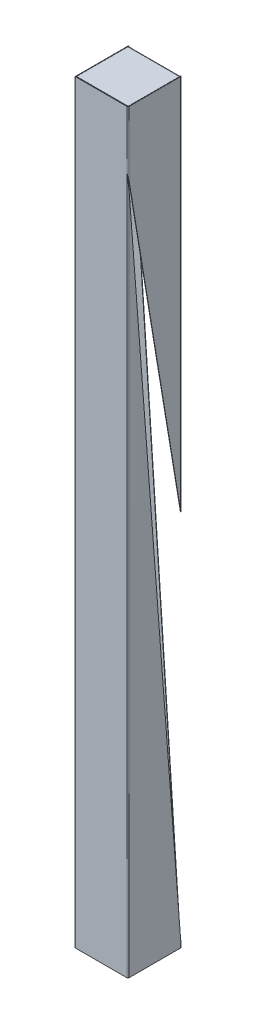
ISO-10303-21;
HEADER;
FILE_DESCRIPTION(('STEP AP214'),'2;1');
FILE_NAME('part.step','',(''),(''),'','','');
FILE_SCHEMA(('AUTOMOTIVE_DESIGN { 1 0 10303 214 1 1 1 1 }'));
ENDSEC;
DATA;
#1=APPLICATION_CONTEXT('core data for automotive mechanical design processes');
#2=APPLICATION_PROTOCOL_DEFINITION('international standard','automotive_design',2000,#1);
#3=PRODUCT_CONTEXT('',#1,'mechanical');
#4=PRODUCT('Part','Part','',(#3));
#5=PRODUCT_RELATED_PRODUCT_CATEGORY('part','',(#4));
#6=PRODUCT_DEFINITION_FORMATION('','',#4);
#7=PRODUCT_DEFINITION_CONTEXT('part definition',#1,'design');
#8=PRODUCT_DEFINITION('design','',#6,#7);
#9=PRODUCT_DEFINITION_SHAPE('','',#8);
#10=(LENGTH_UNIT() NAMED_UNIT(*) SI_UNIT(.MILLI.,.METRE.));
#11=(NAMED_UNIT(*) PLANE_ANGLE_UNIT() SI_UNIT($,.RADIAN.));
#12=(NAMED_UNIT(*) SI_UNIT($,.STERADIAN.) SOLID_ANGLE_UNIT());
#13=UNCERTAINTY_MEASURE_WITH_UNIT(LENGTH_MEASURE(1.E-05),#10,'distance_accuracy_value','');
#14=(GEOMETRIC_REPRESENTATION_CONTEXT(3) GLOBAL_UNCERTAINTY_ASSIGNED_CONTEXT((#13)) GLOBAL_UNIT_ASSIGNED_CONTEXT((#10,
#11,#12)) REPRESENTATION_CONTEXT('',''));
#15=CARTESIAN_POINT('',(0.,0.,0.));
#16=DIRECTION('',(0.,0.,1.));
#17=DIRECTION('',(1.,0.,0.));
#18=AXIS2_PLACEMENT_3D('',#15,#16,#17);
#19=CARTESIAN_POINT('',(138.500000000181,1997.,0.999999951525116));
#20=DIRECTION('',(-1.,-6.0248102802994E-11,0.));
#21=DIRECTION('',(6.0248102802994E-11,-1.,0.));
#22=AXIS2_PLACEMENT_3D('',#19,#20,#21);
#23=PLANE('',#22);
#24=DIRECTION('',(0.,-1.,0.));
#25=VECTOR('',#24,1.);
#26=CARTESIAN_POINT('',(138.5,2000.,0.));
#27=LINE('',#26,#25);
#28=CARTESIAN_POINT('',(138.5,2000.,0.));
#29=VERTEX_POINT('',#28);
#30=CARTESIAN_POINT('',(138.5,1996.99999999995,0.));
#31=VERTEX_POINT('',#30);
#32=EDGE_CURVE('E1004',#29,#31,#27,.T.);
#33=ORIENTED_EDGE('',*,*,#32,.T.);
#34=CARTESIAN_POINT('',(138.500000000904,1997.,2.99999995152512));
#35=DIRECTION('',(-1.,0.,3.61493495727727E-10));
#36=DIRECTION('',(3.61493495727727E-10,0.,1.));
#37=AXIS2_PLACEMENT_3D('',#34,#35,#36);
#38=CIRCLE('',#37,3.);
#39=CARTESIAN_POINT('',(138.5,1999.23606802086,1.));
#40=VERTEX_POINT('',#39);
#41=EDGE_CURVE('E174',#31,#40,#38,.F.);
#42=ORIENTED_EDGE('',*,*,#41,.T.);
#43=DIRECTION('',(0.,-1.,0.));
#44=VECTOR('',#43,1.);
#45=CARTESIAN_POINT('',(138.5,2000.,1.));
#46=LINE('',#45,#44);
#47=CARTESIAN_POINT('',(138.5,2000.,0.999999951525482));
#48=VERTEX_POINT('',#47);
#49=EDGE_CURVE('E992',#48,#40,#46,.T.);
#50=ORIENTED_EDGE('',*,*,#49,.F.);
#51=DIRECTION('',(0.,0.,-1.));
#52=VECTOR('',#51,1.);
#53=CARTESIAN_POINT('',(138.5,2000.,1.));
#54=LINE('',#53,#52);
#55=EDGE_CURVE('E981',#48,#29,#54,.T.);
#56=ORIENTED_EDGE('',*,*,#55,.T.);
#57=EDGE_LOOP('',(#33,#42,#50,#56));
#58=FACE_BOUND('',#57,.T.);
#59=ADVANCED_FACE('F154',(#58),#23,.T.);
#60=CARTESIAN_POINT('',(1.5,2000.,1.00000000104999));
#61=DIRECTION('',(1.,0.,0.));
#62=DIRECTION('',(0.,1.,0.));
#63=AXIS2_PLACEMENT_3D('',#60,#61,#62);
#64=PLANE('',#63);
#65=DIRECTION('',(0.,-1.,0.));
#66=VECTOR('',#65,1.);
#67=CARTESIAN_POINT('',(1.5,2000.,1.00000000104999));
#68=LINE('',#67,#66);
#69=CARTESIAN_POINT('',(1.5,2000.,1.00000000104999));
#70=VERTEX_POINT('',#69);
#71=CARTESIAN_POINT('',(1.5,1999.2360679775,1.00000000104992));
#72=VERTEX_POINT('',#71);
#73=EDGE_CURVE('E431',#70,#72,#68,.T.);
#74=ORIENTED_EDGE('',*,*,#73,.T.);
#75=CARTESIAN_POINT('',(1.50000000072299,1997.,3.00000000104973));
#76=DIRECTION('',(-1.,0.,3.61493495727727E-10));
#77=DIRECTION('',(3.61493495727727E-10,0.,1.));
#78=AXIS2_PLACEMENT_3D('',#75,#76,#77);
#79=CIRCLE('',#78,3.);
#80=CARTESIAN_POINT('',(1.5,1997.,0.));
#81=VERTEX_POINT('',#80);
#82=EDGE_CURVE('E13',#72,#81,#79,.T.);
#83=ORIENTED_EDGE('',*,*,#82,.T.);
#84=DIRECTION('',(0.,1.,0.));
#85=VECTOR('',#84,1.);
#86=CARTESIAN_POINT('',(1.5,0.,0.));
#87=LINE('',#86,#85);
#88=CARTESIAN_POINT('',(1.5,2000.,1.04998952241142E-09));
#89=VERTEX_POINT('',#88);
#90=EDGE_CURVE('E1005',#81,#89,#87,.T.);
#91=ORIENTED_EDGE('',*,*,#90,.T.);
#92=DIRECTION('',(0.,0.,-1.));
#93=VECTOR('',#92,1.);
#94=CARTESIAN_POINT('',(1.5,2000.,1.));
#95=LINE('',#94,#93);
#96=EDGE_CURVE('E1128',#70,#89,#95,.T.);
#97=ORIENTED_EDGE('',*,*,#96,.F.);
#98=EDGE_LOOP('',(#74,#83,#91,#97));
#99=FACE_BOUND('',#98,.T.);
#100=ADVANCED_FACE('F455',(#99),#64,.T.);
#101=CARTESIAN_POINT('',(0.,2000.,1.));
#102=DIRECTION('',(0.,0.,-1.));
#103=DIRECTION('',(-1.,0.,0.));
#104=AXIS2_PLACEMENT_3D('',#101,#102,#103);
#105=PLANE('',#104);
#106=DIRECTION('',(-1.,0.,3.61493495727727E-10));
#107=VECTOR('',#106,1.);
#108=CARTESIAN_POINT('',(1.50000000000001,1997.,1.00000000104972));
#109=LINE('',#108,#107);
#110=CARTESIAN_POINT('',(1.50000000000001,1997.,1.00000000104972));
#111=VERTEX_POINT('',#110);
#112=CARTESIAN_POINT('',(138.5,1997.00000000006,1.));
#113=VERTEX_POINT('',#112);
#114=EDGE_CURVE('E425',#111,#113,#109,.F.);
#115=ORIENTED_EDGE('',*,*,#114,.F.);
#116=DIRECTION('',(0.,1.,0.));
#117=VECTOR('',#116,1.);
#118=CARTESIAN_POINT('',(1.5,0.,1.));
#119=LINE('',#118,#117);
#120=CARTESIAN_POINT('',(1.5,1993.85633089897,1.00000000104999));
#121=VERTEX_POINT('',#120);
#122=EDGE_CURVE('E1132',#121,#111,#119,.T.);
#123=ORIENTED_EDGE('',*,*,#122,.F.);
#124=DIRECTION('',(-0.137016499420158,0.990568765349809,0.));
#125=VECTOR('',#124,1.);
#126=CARTESIAN_POINT('',(1.49999999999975,1993.85633089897,1.));
#127=LINE('',#126,#125);
#128=CARTESIAN_POINT('',(138.5,1003.40684906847,0.999999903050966));
#129=VERTEX_POINT('',#128);
#130=EDGE_CURVE('E995',#129,#121,#127,.T.);
#131=ORIENTED_EDGE('',*,*,#130,.F.);
#132=EDGE_CURVE('E999',#113,#129,#46,.T.);
#133=ORIENTED_EDGE('',*,*,#132,.F.);
#134=EDGE_LOOP('',(#115,#123,#131,#133));
#135=FACE_BOUND('',#134,.T.);
#136=ADVANCED_FACE('F1311',(#135),#105,.F.);
#137=CARTESIAN_POINT('',(0.,2000.,0.));
#138=DIRECTION('',(0.,0.,-1.));
#139=DIRECTION('',(-1.,0.,0.));
#140=AXIS2_PLACEMENT_3D('',#137,#138,#139);
#141=PLANE('',#140);
#142=CARTESIAN_POINT('',(1.5,1993.85633089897,1.04998952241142E-09));
#143=VERTEX_POINT('',#142);
#144=EDGE_CURVE('E1124',#143,#81,#87,.T.);
#145=ORIENTED_EDGE('',*,*,#144,.T.);
#146=DIRECTION('',(-1.,0.,3.61493495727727E-10));
#147=VECTOR('',#146,1.);
#148=CARTESIAN_POINT('',(1.49999999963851,1997.,1.04972497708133E-09));
#149=LINE('',#148,#147);
#150=EDGE_CURVE('E417',#81,#31,#149,.F.);
#151=ORIENTED_EDGE('',*,*,#150,.T.);
#152=CARTESIAN_POINT('',(138.5,1003.40684906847,-9.69490338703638E-08));
#153=VERTEX_POINT('',#152);
#154=EDGE_CURVE('E1001',#31,#153,#27,.T.);
#155=ORIENTED_EDGE('',*,*,#154,.T.);
#156=DIRECTION('',(-0.137016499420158,0.990568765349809,0.));
#157=VECTOR('',#156,1.);
#158=CARTESIAN_POINT('',(1.49999999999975,1993.85633089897,0.));
#159=LINE('',#158,#157);
#160=EDGE_CURVE('E984',#153,#143,#159,.T.);
#161=ORIENTED_EDGE('',*,*,#160,.T.);
#162=EDGE_LOOP('',(#145,#151,#155,#161));
#163=FACE_BOUND('',#162,.T.);
#164=ADVANCED_FACE('F1316',(#163),#141,.T.);
#165=CARTESIAN_POINT('',(140.,2000.,1.));
#166=DIRECTION('',(-1.,0.,0.));
#167=DIRECTION('',(0.,0.,1.));
#168=AXIS2_PLACEMENT_3D('',#165,#166,#167);
#169=PLANE('',#168);
#170=DIRECTION('',(0.,-1.,0.));
#171=VECTOR('',#170,1.);
#172=CARTESIAN_POINT('',(140.,2000.,138.));
#173=LINE('',#172,#171);
#174=CARTESIAN_POINT('',(140.,2000.,138.));
#175=VERTEX_POINT('',#174);
#176=CARTESIAN_POINT('',(140.0000000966,1829.16905943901,138.));
#177=VERTEX_POINT('',#176);
#178=EDGE_CURVE('E1099',#175,#177,#173,.T.);
#179=ORIENTED_EDGE('',*,*,#178,.T.);
#180=DIRECTION('',(0.,-0.986629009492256,-0.162982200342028));
#181=VECTOR('',#180,1.);
#182=CARTESIAN_POINT('',(140.,1000.,1.02876110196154));
#183=LINE('',#182,#181);
#184=CARTESIAN_POINT('',(140.,1002.85269168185,1.5));
#185=VERTEX_POINT('',#184);
#186=EDGE_CURVE('E1184',#177,#185,#183,.T.);
#187=ORIENTED_EDGE('',*,*,#186,.T.);
#188=DIRECTION('',(0.,-1.,0.));
#189=VECTOR('',#188,1.);
#190=CARTESIAN_POINT('',(140.,0.,1.5));
#191=LINE('',#190,#189);
#192=CARTESIAN_POINT('',(140.,2000.,1.5));
#193=VERTEX_POINT('',#192);
#194=EDGE_CURVE('E1172',#193,#185,#191,.T.);
#195=ORIENTED_EDGE('',*,*,#194,.F.);
#196=DIRECTION('',(0.,0.,1.));
#197=VECTOR('',#196,1.);
#198=CARTESIAN_POINT('',(140.,2000.,1.));
#199=LINE('',#198,#197);
#200=EDGE_CURVE('E1187',#193,#175,#199,.T.);
#201=ORIENTED_EDGE('',*,*,#200,.T.);
#202=EDGE_LOOP('',(#179,#187,#195,#201));
#203=FACE_BOUND('',#202,.T.);
#204=ADVANCED_FACE('F1059',(#203),#169,.F.);
#205=CARTESIAN_POINT('',(139.,2000.,1.00000000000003));
#206=DIRECTION('',(-1.,0.,0.));
#207=DIRECTION('',(0.,0.,1.));
#208=AXIS2_PLACEMENT_3D('',#205,#206,#207);
#209=PLANE('',#208);
#210=DIRECTION('',(0.,-0.986629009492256,-0.162982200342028));
#211=VECTOR('',#210,1.);
#212=CARTESIAN_POINT('',(139.,1000.,1.02876110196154));
#213=LINE('',#212,#211);
#214=CARTESIAN_POINT('',(139.,1829.16905943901,138.));
#215=VERTEX_POINT('',#214);
#216=CARTESIAN_POINT('',(139.,1002.85269168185,1.5));
#217=VERTEX_POINT('',#216);
#218=EDGE_CURVE('E1161',#215,#217,#213,.T.);
#219=ORIENTED_EDGE('',*,*,#218,.F.);
#220=DIRECTION('',(0.,-1.,0.));
#221=VECTOR('',#220,1.);
#222=CARTESIAN_POINT('',(139.,2000.,138.));
#223=LINE('',#222,#221);
#224=CARTESIAN_POINT('',(139.,2000.,138.));
#225=VERTEX_POINT('',#224);
#226=EDGE_CURVE('E505',#225,#215,#223,.T.);
#227=ORIENTED_EDGE('',*,*,#226,.F.);
#228=DIRECTION('',(0.,0.,-1.));
#229=VECTOR('',#228,1.);
#230=CARTESIAN_POINT('',(139.000000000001,2000.,141.));
#231=LINE('',#230,#229);
#232=CARTESIAN_POINT('',(139.000000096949,2000.,1.49999999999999));
#233=VERTEX_POINT('',#232);
#234=EDGE_CURVE('E1180',#233,#225,#231,.F.);
#235=ORIENTED_EDGE('',*,*,#234,.F.);
#236=DIRECTION('',(0.,1.,0.));
#237=VECTOR('',#236,1.);
#238=CARTESIAN_POINT('',(139.,0.,1.50000000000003));
#239=LINE('',#238,#237);
#240=EDGE_CURVE('E1179',#217,#233,#239,.T.);
#241=ORIENTED_EDGE('',*,*,#240,.F.);
#242=EDGE_LOOP('',(#219,#227,#235,#241));
#243=FACE_BOUND('',#242,.T.);
#244=ADVANCED_FACE('F1063',(#243),#209,.T.);
#245=CARTESIAN_POINT('',(140.000000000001,2000.,141.));
#246=DIRECTION('',(0.,-1.,0.));
#247=DIRECTION('',(0.,0.,-1.));
#248=AXIS2_PLACEMENT_3D('',#245,#246,#247);
#249=PLANE('',#248);
#250=DIRECTION('',(1.,0.,0.));
#251=VECTOR('',#250,1.);
#252=CARTESIAN_POINT('',(139.,2000.,138.));
#253=LINE('',#252,#251);
#254=EDGE_CURVE('E1101',#225,#175,#253,.T.);
#255=ORIENTED_EDGE('',*,*,#254,.T.);
#256=ORIENTED_EDGE('',*,*,#200,.F.);
#257=DIRECTION('',(1.,0.,0.));
#258=VECTOR('',#257,1.);
#259=CARTESIAN_POINT('',(139.,2000.,1.50000000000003));
#260=LINE('',#259,#258);
#261=EDGE_CURVE('E1176',#233,#193,#260,.T.);
#262=ORIENTED_EDGE('',*,*,#261,.F.);
#263=ORIENTED_EDGE('',*,*,#234,.T.);
#264=EDGE_LOOP('',(#255,#256,#262,#263));
#265=FACE_BOUND('',#264,.T.);
#266=ADVANCED_FACE('F1066',(#265),#249,.F.);
#267=CARTESIAN_POINT('',(140.,0.,1.));
#268=DIRECTION('',(0.,1.,0.));
#269=DIRECTION('',(0.,0.,1.));
#270=AXIS2_PLACEMENT_3D('',#267,#268,#269);
#271=PLANE('',#270);
#272=DIRECTION('',(1.,0.,0.));
#273=VECTOR('',#272,1.);
#274=CARTESIAN_POINT('',(139.,0.,138.));
#275=LINE('',#274,#273);
#276=CARTESIAN_POINT('',(139.,0.,138.));
#277=VERTEX_POINT('',#276);
#278=CARTESIAN_POINT('',(140.,0.,138.));
#279=VERTEX_POINT('',#278);
#280=EDGE_CURVE('E1096',#277,#279,#275,.T.);
#281=ORIENTED_EDGE('',*,*,#280,.F.);
#282=DIRECTION('',(0.,0.,1.));
#283=VECTOR('',#282,1.);
#284=CARTESIAN_POINT('',(139.,0.,1.));
#285=LINE('',#284,#283);
#286=CARTESIAN_POINT('',(139.000000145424,0.,1.5));
#287=VERTEX_POINT('',#286);
#288=EDGE_CURVE('E1183',#277,#287,#285,.F.);
#289=ORIENTED_EDGE('',*,*,#288,.T.);
#290=DIRECTION('',(1.,0.,0.));
#291=VECTOR('',#290,1.);
#292=CARTESIAN_POINT('',(140.,0.,1.5));
#293=LINE('',#292,#291);
#294=CARTESIAN_POINT('',(140.,0.,1.5));
#295=VERTEX_POINT('',#294);
#296=EDGE_CURVE('E1133',#287,#295,#293,.T.);
#297=ORIENTED_EDGE('',*,*,#296,.T.);
#298=DIRECTION('',(0.,0.,-1.));
#299=VECTOR('',#298,1.);
#300=CARTESIAN_POINT('',(140.,0.,1.));
#301=LINE('',#300,#299);
#302=EDGE_CURVE('E1189',#279,#295,#301,.T.);
#303=ORIENTED_EDGE('',*,*,#302,.F.);
#304=EDGE_LOOP('',(#281,#289,#297,#303));
#305=FACE_BOUND('',#304,.T.);
#306=ADVANCED_FACE('F1057',(#305),#271,.F.);
#307=DIRECTION('',(0.,-1.,0.));
#308=VECTOR('',#307,1.);
#309=CARTESIAN_POINT('',(140.,0.,1.5));
#310=LINE('',#309,#308);
#311=CARTESIAN_POINT('',(140.000000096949,20.2620655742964,1.50000000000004));
#312=VERTEX_POINT('',#311);
#313=EDGE_CURVE('E1167',#312,#295,#310,.T.);
#314=ORIENTED_EDGE('',*,*,#313,.F.);
#315=DIRECTION('',(0.,0.997091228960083,0.0762173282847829));
#316=VECTOR('',#315,1.);
#317=CARTESIAN_POINT('',(140.,1849.13790121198,141.298672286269));
#318=LINE('',#317,#316);
#319=CARTESIAN_POINT('',(140.,1805.98397181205,138.));
#320=VERTEX_POINT('',#319);
#321=EDGE_CURVE('E1165',#312,#320,#318,.T.);
#322=ORIENTED_EDGE('',*,*,#321,.T.);
#323=DIRECTION('',(0.,-1.,0.));
#324=VECTOR('',#323,1.);
#325=CARTESIAN_POINT('',(140.,2000.,138.));
#326=LINE('',#325,#324);
#327=EDGE_CURVE('E1088',#320,#279,#326,.T.);
#328=ORIENTED_EDGE('',*,*,#327,.T.);
#329=ORIENTED_EDGE('',*,*,#302,.T.);
#330=EDGE_LOOP('',(#314,#322,#328,#329));
#331=FACE_BOUND('',#330,.T.);
#332=ADVANCED_FACE('F1053',(#331),#169,.F.);
#333=DIRECTION('',(0.,0.997091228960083,0.0762173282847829));
#334=VECTOR('',#333,1.);
#335=CARTESIAN_POINT('',(139.,1849.13790121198,141.298672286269));
#336=LINE('',#335,#334);
#337=CARTESIAN_POINT('',(139.000000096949,20.2620655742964,1.50000000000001));
#338=VERTEX_POINT('',#337);
#339=CARTESIAN_POINT('',(139.0000000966,1805.98397181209,138.000000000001));
#340=VERTEX_POINT('',#339);
#341=EDGE_CURVE('E979',#338,#340,#336,.T.);
#342=ORIENTED_EDGE('',*,*,#341,.F.);
#343=DIRECTION('',(0.,1.,0.));
#344=VECTOR('',#343,1.);
#345=CARTESIAN_POINT('',(139.,0.,1.50000000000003));
#346=LINE('',#345,#344);
#347=EDGE_CURVE('E1168',#287,#338,#346,.T.);
#348=ORIENTED_EDGE('',*,*,#347,.F.);
#349=ORIENTED_EDGE('',*,*,#288,.F.);
#350=DIRECTION('',(0.,-1.,0.));
#351=VECTOR('',#350,1.);
#352=CARTESIAN_POINT('',(139.,2000.,138.));
#353=LINE('',#352,#351);
#354=EDGE_CURVE('E1151',#340,#277,#353,.T.);
#355=ORIENTED_EDGE('',*,*,#354,.F.);
#356=EDGE_LOOP('',(#342,#348,#349,#355));
#357=FACE_BOUND('',#356,.T.);
#358=ADVANCED_FACE('F1056',(#357),#209,.T.);
#359=CARTESIAN_POINT('',(140.,1000.,1.02876110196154));
#360=DIRECTION('',(0.,0.162982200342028,-0.986629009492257));
#361=DIRECTION('',(0.,-0.986629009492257,-0.162982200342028));
#362=AXIS2_PLACEMENT_3D('',#359,#360,#361);
#363=PLANE('',#362);
#364=CARTESIAN_POINT('',(139.0000000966,1829.16905943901,138.));
#365=CARTESIAN_POINT('',(140.0000000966,1829.16905943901,138.));
#366=B_SPLINE_CURVE_WITH_KNOTS('',1,(#364,#365),.UNSPECIFIED.,.F.,.F.,(2,2),(0.,1.),.UNSPECIFIED.);
#367=EDGE_CURVE('E1102',#215,#177,#366,.T.);
#368=ORIENTED_EDGE('',*,*,#367,.F.);
#369=ORIENTED_EDGE('',*,*,#218,.T.);
#370=CARTESIAN_POINT('',(140.000000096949,1002.85269168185,1.49999999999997));
#371=CARTESIAN_POINT('',(139.000000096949,1002.85269168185,1.49999999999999));
#372=B_SPLINE_CURVE_WITH_KNOTS('',1,(#370,#371),.UNSPECIFIED.,.F.,.F.,(2,2),(0.,1.),.UNSPECIFIED.);
#373=EDGE_CURVE('E1170',#185,#217,#372,.T.);
#374=ORIENTED_EDGE('',*,*,#373,.F.);
#375=ORIENTED_EDGE('',*,*,#186,.F.);
#376=EDGE_LOOP('',(#368,#369,#374,#375));
#377=FACE_BOUND('',#376,.T.);
#378=ADVANCED_FACE('F156',(#377),#363,.F.);
#379=CARTESIAN_POINT('',(140.,1849.13790121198,141.298672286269));
#380=DIRECTION('',(0.,-0.0762173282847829,0.997091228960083));
#381=DIRECTION('',(0.,0.997091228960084,0.0762173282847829));
#382=AXIS2_PLACEMENT_3D('',#379,#380,#381);
#383=PLANE('',#382);
#384=CARTESIAN_POINT('',(140.0000000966,1805.98397181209,138.000000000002));
#385=CARTESIAN_POINT('',(139.0000000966,1805.98397181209,138.000000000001));
#386=B_SPLINE_CURVE_WITH_KNOTS('',1,(#384,#385),.UNSPECIFIED.,.F.,.F.,(2,2),(0.,1.),.UNSPECIFIED.);
#387=EDGE_CURVE('E165',#320,#340,#386,.T.);
#388=ORIENTED_EDGE('',*,*,#387,.F.);
#389=ORIENTED_EDGE('',*,*,#321,.F.);
#390=CARTESIAN_POINT('',(139.000000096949,20.2620655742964,1.50000000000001));
#391=CARTESIAN_POINT('',(140.000000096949,20.2620655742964,1.50000000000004));
#392=B_SPLINE_CURVE_WITH_KNOTS('',1,(#390,#391),.UNSPECIFIED.,.F.,.F.,(2,2),(0.,1.),.UNSPECIFIED.);
#393=EDGE_CURVE('E825',#338,#312,#392,.T.);
#394=ORIENTED_EDGE('',*,*,#393,.F.);
#395=ORIENTED_EDGE('',*,*,#341,.T.);
#396=EDGE_LOOP('',(#388,#389,#394,#395));
#397=FACE_BOUND('',#396,.T.);
#398=ADVANCED_FACE('F1070',(#397),#383,.F.);
#399=DIRECTION('',(0.,-1.,0.));
#400=VECTOR('',#399,1.);
#401=CARTESIAN_POINT('',(138.5,2000.,1.));
#402=LINE('',#401,#400);
#403=CARTESIAN_POINT('',(138.5,8.03609582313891,0.999999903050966));
#404=VERTEX_POINT('',#403);
#405=CARTESIAN_POINT('',(138.5,0.,1.));
#406=VERTEX_POINT('',#405);
#407=EDGE_CURVE('E991',#404,#406,#402,.T.);
#408=ORIENTED_EDGE('',*,*,#407,.F.);
#409=DIRECTION('',(0.0688255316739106,-0.997628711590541,0.));
#410=VECTOR('',#409,1.);
#411=CARTESIAN_POINT('',(1.49999999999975,1993.85633089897,1.));
#412=LINE('',#411,#410);
#413=EDGE_CURVE('E1017',#121,#404,#412,.T.);
#414=ORIENTED_EDGE('',*,*,#413,.F.);
#415=DIRECTION('',(0.,1.,0.));
#416=VECTOR('',#415,1.);
#417=CARTESIAN_POINT('',(1.5,0.,1.));
#418=LINE('',#417,#416);
#419=CARTESIAN_POINT('',(1.5,0.,1.00000000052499));
#420=VERTEX_POINT('',#419);
#421=EDGE_CURVE('E1130',#420,#121,#418,.T.);
#422=ORIENTED_EDGE('',*,*,#421,.F.);
#423=DIRECTION('',(1.,0.,0.));
#424=VECTOR('',#423,1.);
#425=CARTESIAN_POINT('',(0.,0.,1.));
#426=LINE('',#425,#424);
#427=EDGE_CURVE('E985',#420,#406,#426,.T.);
#428=ORIENTED_EDGE('',*,*,#427,.T.);
#429=EDGE_LOOP('',(#408,#414,#422,#428));
#430=FACE_BOUND('',#429,.T.);
#431=ADVANCED_FACE('F1073',(#430),#105,.F.);
#432=CARTESIAN_POINT('',(1.49999999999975,1993.85633089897,0.));
#433=DIRECTION('',(0.99056876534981,0.137016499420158,0.));
#434=DIRECTION('',(-0.137016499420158,0.990568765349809,0.));
#435=AXIS2_PLACEMENT_3D('',#432,#433,#434);
#436=PLANE('',#435);
#437=CARTESIAN_POINT('',(138.5,1003.40684906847,0.999999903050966));
#438=CARTESIAN_POINT('',(138.5,1003.40684906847,-9.69490338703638E-08));
#439=B_SPLINE_CURVE_WITH_KNOTS('',1,(#437,#438),.UNSPECIFIED.,.F.,.F.,(2,2),(0.,1.),.UNSPECIFIED.);
#440=EDGE_CURVE('E968',#129,#153,#439,.T.);
#441=ORIENTED_EDGE('',*,*,#440,.F.);
#442=ORIENTED_EDGE('',*,*,#130,.T.);
#443=DIRECTION('',(0.,0.,1.));
#444=VECTOR('',#443,1.);
#445=CARTESIAN_POINT('',(1.49999999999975,1993.85633089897,0.));
#446=LINE('',#445,#444);
#447=EDGE_CURVE('E1021',#143,#121,#446,.T.);
#448=ORIENTED_EDGE('',*,*,#447,.F.);
#449=ORIENTED_EDGE('',*,*,#160,.F.);
#450=EDGE_LOOP('',(#441,#442,#448,#449));
#451=FACE_BOUND('',#450,.T.);
#452=ADVANCED_FACE('F1046',(#451),#436,.F.);
#453=CARTESIAN_POINT('',(1.49999999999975,1993.85633089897,0.));
#454=DIRECTION('',(-0.997628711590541,-0.0688255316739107,0.));
#455=DIRECTION('',(0.0688255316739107,-0.997628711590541,0.));
#456=AXIS2_PLACEMENT_3D('',#453,#454,#455);
#457=PLANE('',#456);
#458=CARTESIAN_POINT('',(138.5,8.03609582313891,-9.69490338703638E-08));
#459=CARTESIAN_POINT('',(138.5,8.03609582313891,0.999999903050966));
#460=B_SPLINE_CURVE_WITH_KNOTS('',1,(#458,#459),.UNSPECIFIED.,.F.,.F.,(2,2),(0.,1.),.UNSPECIFIED.);
#461=CARTESIAN_POINT('',(138.5,8.03609582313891,0.));
#462=VERTEX_POINT('',#461);
#463=EDGE_CURVE('E990',#462,#404,#460,.T.);
#464=ORIENTED_EDGE('',*,*,#463,.F.);
#465=DIRECTION('',(0.0688255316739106,-0.997628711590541,0.));
#466=VECTOR('',#465,1.);
#467=CARTESIAN_POINT('',(1.49999999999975,1993.85633089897,0.));
#468=LINE('',#467,#466);
#469=EDGE_CURVE('E1020',#143,#462,#468,.T.);
#470=ORIENTED_EDGE('',*,*,#469,.F.);
#471=ORIENTED_EDGE('',*,*,#447,.T.);
#472=ORIENTED_EDGE('',*,*,#413,.T.);
#473=EDGE_LOOP('',(#464,#470,#471,#472));
#474=FACE_BOUND('',#473,.T.);
#475=ADVANCED_FACE('F1035',(#474),#457,.F.);
#476=ORIENTED_EDGE('',*,*,#469,.T.);
#477=DIRECTION('',(0.,-1.,0.));
#478=VECTOR('',#477,1.);
#479=CARTESIAN_POINT('',(138.5,2000.,0.));
#480=LINE('',#479,#478);
#481=CARTESIAN_POINT('',(138.5,0.,0.));
#482=VERTEX_POINT('',#481);
#483=EDGE_CURVE('E980',#462,#482,#480,.T.);
#484=ORIENTED_EDGE('',*,*,#483,.T.);
#485=DIRECTION('',(1.,0.,0.));
#486=VECTOR('',#485,1.);
#487=CARTESIAN_POINT('',(0.,0.,0.));
#488=LINE('',#487,#486);
#489=CARTESIAN_POINT('',(1.5,0.,0.));
#490=VERTEX_POINT('',#489);
#491=EDGE_CURVE('E972',#490,#482,#488,.T.);
#492=ORIENTED_EDGE('',*,*,#491,.F.);
#493=DIRECTION('',(0.,1.,0.));
#494=VECTOR('',#493,1.);
#495=CARTESIAN_POINT('',(1.5,0.,0.));
#496=LINE('',#495,#494);
#497=EDGE_CURVE('E1120',#490,#143,#496,.T.);
#498=ORIENTED_EDGE('',*,*,#497,.T.);
#499=EDGE_LOOP('',(#476,#484,#492,#498));
#500=FACE_BOUND('',#499,.T.);
#501=ADVANCED_FACE('F1045',(#500),#141,.T.);
#502=CARTESIAN_POINT('',(0.,0.,1.));
#503=DIRECTION('',(0.,1.,0.));
#504=DIRECTION('',(0.,0.,1.));
#505=AXIS2_PLACEMENT_3D('',#502,#503,#504);
#506=PLANE('',#505);
#507=DIRECTION('',(0.,0.,-1.));
#508=VECTOR('',#507,1.);
#509=CARTESIAN_POINT('',(1.5,0.,1.));
#510=LINE('',#509,#508);
#511=EDGE_CURVE('E1117',#420,#490,#510,.T.);
#512=ORIENTED_EDGE('',*,*,#511,.T.);
#513=ORIENTED_EDGE('',*,*,#491,.T.);
#514=DIRECTION('',(0.,0.,-1.));
#515=VECTOR('',#514,1.);
#516=CARTESIAN_POINT('',(138.5,0.,1.));
#517=LINE('',#516,#515);
#518=EDGE_CURVE('E987',#406,#482,#517,.T.);
#519=ORIENTED_EDGE('',*,*,#518,.F.);
#520=ORIENTED_EDGE('',*,*,#427,.F.);
#521=EDGE_LOOP('',(#512,#513,#519,#520));
#522=FACE_BOUND('',#521,.T.);
#523=ADVANCED_FACE('F1049',(#522),#506,.F.);
#524=CARTESIAN_POINT('',(138.5,1003.40684906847,-9.69490338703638E-08));
#525=CARTESIAN_POINT('',(138.696353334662,1002.83902995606,-9.69490447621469E-08));
#526=CARTESIAN_POINT('',(138.892621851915,1002.27123271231,0.0390408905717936));
#527=CARTESIAN_POINT('',(139.255428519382,1001.13561635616,0.189320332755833));
#528=CARTESIAN_POINT('',(139.421817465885,1000.56781911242,0.30049698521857));
#529=CARTESIAN_POINT('',(139.560660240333,1000.,0.439339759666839));
#530=CARTESIAN_POINT('',(138.5,1003.40684906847,0.999999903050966));
#531=CARTESIAN_POINT('',(138.565450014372,1002.83903954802,0.999999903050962));
#532=CARTESIAN_POINT('',(138.630873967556,1002.27123271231,1.01301356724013));
#533=CARTESIAN_POINT('',(138.751809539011,1001.13561635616,1.06310672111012));
#534=CARTESIAN_POINT('',(138.807273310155,1000.56780952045,1.100166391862));
#535=CARTESIAN_POINT('',(138.853553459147,1000.,1.1464465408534));
#536=B_SPLINE_SURFACE_WITH_KNOTS('',1,3,((#524,#525,#526,#527,#528,#529),(#530,#531,#532,#533,
#534,#535)),.UNSPECIFIED.,.F.,.F.,.F.,(2,2),(4,2,4),(0.,1.),(0.,0.5,1.),.UNSPECIFIED.);
#537=CARTESIAN_POINT('',(138.5,1003.40684906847,-9.69490338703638E-08));
#538=CARTESIAN_POINT('',(138.696353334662,1002.83902995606,-9.69490447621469E-08));
#539=CARTESIAN_POINT('',(138.892621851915,1002.27123271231,0.0390408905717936));
#540=CARTESIAN_POINT('',(139.255428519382,1001.13561635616,0.189320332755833));
#541=CARTESIAN_POINT('',(139.421817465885,1000.56781911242,0.30049698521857));
#542=CARTESIAN_POINT('',(139.560660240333,1000.,0.439339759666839));
#543=B_SPLINE_CURVE_WITH_KNOTS('',3,(#537,#538,#539,#540,#541,#542),.UNSPECIFIED.,.F.,.F.,(4,2,
4),(0.,0.5,1.),.UNSPECIFIED.);
#544=CARTESIAN_POINT('',(139.560660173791,1000.00000027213,0.439339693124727));
#545=VERTEX_POINT('',#544);
#546=EDGE_CURVE('E881',#153,#545,#543,.T.);
#547=CARTESIAN_POINT('',(139.560660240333,1000.,0.439339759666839));
#548=CARTESIAN_POINT('',(138.853553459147,1000.,1.1464465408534));
#549=B_SPLINE_CURVE_WITH_KNOTS('',1,(#547,#548),.UNSPECIFIED.,.F.,.F.,(2,2),(0.,1.),.UNSPECIFIED.);
#550=CARTESIAN_POINT('',(138.853553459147,1000.,1.1464465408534));
#551=VERTEX_POINT('',#550);
#552=EDGE_CURVE('E837',#545,#551,#549,.T.);
#553=CARTESIAN_POINT('',(138.853553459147,1000.,1.1464465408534));
#554=CARTESIAN_POINT('',(138.807273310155,1000.56780952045,1.100166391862));
#555=CARTESIAN_POINT('',(138.751809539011,1001.13561635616,1.06310672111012));
#556=CARTESIAN_POINT('',(138.630873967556,1002.27123271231,1.01301356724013));
#557=CARTESIAN_POINT('',(138.565450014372,1002.83903954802,0.999999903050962));
#558=CARTESIAN_POINT('',(138.5,1003.40684906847,0.999999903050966));
#559=B_SPLINE_CURVE_WITH_KNOTS('',3,(#553,#554,#555,#556,#557,#558),.UNSPECIFIED.,.F.,.F.,(4,2,
4),(0.,0.5,1.),.UNSPECIFIED.);
#560=EDGE_CURVE('E842',#129,#551,#559,.F.);
#561=ORIENTED_EDGE('',*,*,#440,.T.);
#562=ORIENTED_EDGE('',*,*,#546,.T.);
#563=ORIENTED_EDGE('',*,*,#552,.T.);
#564=ORIENTED_EDGE('',*,*,#560,.F.);
#565=EDGE_LOOP('',(#561,#562,#563,#564));
#566=FACE_BOUND('',#565,.T.);
#567=ADVANCED_FACE('F922',(#566),#536,.F.);
#568=CARTESIAN_POINT('',(139.560660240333,1000.,0.439339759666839));
#569=CARTESIAN_POINT('',(139.699503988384,1000.47546110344,0.578183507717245));
#570=CARTESIAN_POINT('',(139.810679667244,1000.95089722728,0.744571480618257));
#571=CARTESIAN_POINT('',(139.960959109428,1001.90179445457,1.10737814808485));
#572=CARTESIAN_POINT('',(140.000000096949,1002.37723057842,1.30364528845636));
#573=CARTESIAN_POINT('',(140.000000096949,1002.85269168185,1.49999999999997));
#574=CARTESIAN_POINT('',(138.853553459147,1000.,1.1464465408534));
#575=CARTESIAN_POINT('',(138.899833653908,1000.47545020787,1.19272673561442));
#576=CARTESIAN_POINT('',(138.93689327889,1000.95089722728,1.24819046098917));
#577=CARTESIAN_POINT('',(138.98698643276,1001.90179445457,1.36912603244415));
#578=CARTESIAN_POINT('',(139.000000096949,1002.37724147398,1.43454992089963));
#579=CARTESIAN_POINT('',(139.000000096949,1002.85269168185,1.49999999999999));
#580=B_SPLINE_SURFACE_WITH_KNOTS('',1,3,((#568,#569,#570,#571,#572,#573),(#574,#575,#576,#577,
#578,#579)),.UNSPECIFIED.,.F.,.F.,.F.,(2,2),(4,2,4),(0.,1.),(0.,0.5,1.),.UNSPECIFIED.);
#581=CARTESIAN_POINT('',(139.560660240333,1000.,0.439339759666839));
#582=CARTESIAN_POINT('',(139.699503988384,1000.47546110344,0.578183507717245));
#583=CARTESIAN_POINT('',(139.810679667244,1000.95089722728,0.744571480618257));
#584=CARTESIAN_POINT('',(139.960959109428,1001.90179445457,1.10737814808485));
#585=CARTESIAN_POINT('',(140.000000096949,1002.37723057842,1.30364528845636));
#586=CARTESIAN_POINT('',(140.000000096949,1002.85269168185,1.49999999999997));
#587=B_SPLINE_CURVE_WITH_KNOTS('',3,(#581,#582,#583,#584,#585,#586),.UNSPECIFIED.,.F.,.F.,(4,2,
4),(0.,0.5,1.),.UNSPECIFIED.);
#588=EDGE_CURVE('E843',#545,#185,#587,.T.);
#589=CARTESIAN_POINT('',(139.000000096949,1002.85269168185,1.49999999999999));
#590=CARTESIAN_POINT('',(139.000000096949,1002.37724147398,1.43454992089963));
#591=CARTESIAN_POINT('',(138.98698643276,1001.90179445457,1.36912603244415));
#592=CARTESIAN_POINT('',(138.93689327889,1000.95089722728,1.24819046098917));
#593=CARTESIAN_POINT('',(138.899833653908,1000.47545020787,1.19272673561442));
#594=CARTESIAN_POINT('',(138.853553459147,1000.,1.1464465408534));
#595=B_SPLINE_CURVE_WITH_KNOTS('',3,(#589,#590,#591,#592,#593,#594),.UNSPECIFIED.,.F.,.F.,(4,2,
4),(0.,0.5,1.),.UNSPECIFIED.);
#596=EDGE_CURVE('E838',#551,#217,#595,.F.);
#597=ORIENTED_EDGE('',*,*,#552,.F.);
#598=ORIENTED_EDGE('',*,*,#588,.T.);
#599=ORIENTED_EDGE('',*,*,#373,.T.);
#600=ORIENTED_EDGE('',*,*,#596,.F.);
#601=EDGE_LOOP('',(#597,#598,#599,#600));
#602=FACE_BOUND('',#601,.T.);
#603=ADVANCED_FACE('F911',(#602),#580,.F.);
#604=CARTESIAN_POINT('',(138.5,2000.,1.50000009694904));
#605=DIRECTION('',(0.,-1.,0.));
#606=DIRECTION('',(0.,0.,-1.));
#607=AXIS2_PLACEMENT_3D('',#604,#605,#606);
#608=PLANE('',#607);
#609=ORIENTED_EDGE('',*,*,#261,.T.);
#610=CARTESIAN_POINT('',(138.5,2000.,1.5));
#611=DIRECTION('',(0.,1.,0.));
#612=DIRECTION('',(0.,0.,1.));
#613=AXIS2_PLACEMENT_3D('',#610,#611,#612);
#614=CIRCLE('',#613,1.50000009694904);
#615=EDGE_CURVE('E839',#193,#29,#614,.T.);
#616=ORIENTED_EDGE('',*,*,#615,.T.);
#617=ORIENTED_EDGE('',*,*,#55,.F.);
#618=CARTESIAN_POINT('',(138.5,2000.,1.50000009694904));
#619=DIRECTION('',(0.,1.,0.));
#620=DIRECTION('',(0.,0.,1.));
#621=AXIS2_PLACEMENT_3D('',#618,#619,#620);
#622=CIRCLE('',#621,0.500000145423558);
#623=EDGE_CURVE('E829',#233,#48,#622,.T.);
#624=ORIENTED_EDGE('',*,*,#623,.F.);
#625=EDGE_LOOP('',(#609,#616,#617,#624));
#626=FACE_BOUND('',#625,.T.);
#627=ADVANCED_FACE('F895',(#626),#608,.F.);
#628=CARTESIAN_POINT('',(138.5,501.702480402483,1.5));
#629=DIRECTION('',(0.,1.,0.));
#630=DIRECTION('',(0.,0.,1.));
#631=AXIS2_PLACEMENT_3D('',#628,#629,#630);
#632=CYLINDRICAL_SURFACE('',#631,0.500000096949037);
#633=ORIENTED_EDGE('',*,*,#623,.T.);
#634=ORIENTED_EDGE('',*,*,#49,.T.);
#635=EDGE_CURVE('E159',#40,#113,#46,.T.);
#636=ORIENTED_EDGE('',*,*,#635,.T.);
#637=ORIENTED_EDGE('',*,*,#132,.T.);
#638=ORIENTED_EDGE('',*,*,#560,.T.);
#639=ORIENTED_EDGE('',*,*,#596,.T.);
#640=ORIENTED_EDGE('',*,*,#240,.T.);
#641=EDGE_LOOP('',(#633,#634,#636,#637,#638,#639,#640));
#642=FACE_BOUND('',#641,.T.);
#643=ADVANCED_FACE('F787',(#642),#632,.F.);
#644=CARTESIAN_POINT('',(138.5,501.702480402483,1.5));
#645=DIRECTION('',(0.,1.,0.));
#646=DIRECTION('',(0.,0.,1.));
#647=AXIS2_PLACEMENT_3D('',#644,#645,#646);
#648=CYLINDRICAL_SURFACE('',#647,1.50000009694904);
#649=ORIENTED_EDGE('',*,*,#615,.F.);
#650=ORIENTED_EDGE('',*,*,#194,.T.);
#651=ORIENTED_EDGE('',*,*,#588,.F.);
#652=ORIENTED_EDGE('',*,*,#546,.F.);
#653=ORIENTED_EDGE('',*,*,#154,.F.);
#654=ORIENTED_EDGE('',*,*,#32,.F.);
#655=EDGE_LOOP('',(#649,#650,#651,#652,#653,#654));
#656=FACE_BOUND('',#655,.T.);
#657=ADVANCED_FACE('F783',(#656),#648,.T.);
#658=CARTESIAN_POINT('',(140.000000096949,20.2620655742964,1.50000000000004));
#659=CARTESIAN_POINT('',(140.000000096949,19.2386850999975,1.30443281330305));
#660=CARTESIAN_POINT('',(139.961273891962,18.2153174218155,1.10894380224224));
#661=CARTESIAN_POINT('',(139.812160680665,16.1685692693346,0.747350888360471));
#662=CARTESIAN_POINT('',(139.701831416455,15.1451951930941,0.581388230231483));
#663=CARTESIAN_POINT('',(139.426127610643,13.0984470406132,0.303950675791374));
#664=CARTESIAN_POINT('',(139.260859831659,12.0750729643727,0.192583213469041));
#665=CARTESIAN_POINT('',(138.900208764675,10.0283248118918,0.0412062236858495));
#666=CARTESIAN_POINT('',(138.704966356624,9.00495713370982,0.0012553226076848));
#667=CARTESIAN_POINT('',(138.509403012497,7.9815766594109,2.93755532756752E-05));
#668=CARTESIAN_POINT('',(139.000000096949,20.2620655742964,1.50000000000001));
#669=CARTESIAN_POINT('',(139.000000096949,19.2386907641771,1.43481129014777));
#670=CARTESIAN_POINT('',(138.987091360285,18.2153174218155,1.36964791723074));
#671=CARTESIAN_POINT('',(138.937386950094,16.1685692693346,1.24911693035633));
#672=CARTESIAN_POINT('',(138.900610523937,15.1451951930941,1.19379603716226));
#673=CARTESIAN_POINT('',(138.808709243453,13.0984470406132,1.10131684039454));
#674=CARTESIAN_POINT('',(138.753619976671,12.0750729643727,1.06419434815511));
#675=CARTESIAN_POINT('',(138.633402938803,10.0283248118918,1.01373534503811));
#676=CARTESIAN_POINT('',(138.568321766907,9.00495146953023,1.00041837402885));
#677=CARTESIAN_POINT('',(138.503134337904,7.9815766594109,1.00000972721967));
#678=B_SPLINE_SURFACE_WITH_KNOTS('',1,3,((#658,#659,#660,#661,#662,#663,#664,#665,#666,#667),
(#668,#669,#670,#671,#672,#673,#674,#675,#676,#677)),.UNSPECIFIED.,.F.,.F.,.F.,(2,2),(4,2,2,2,
4),(0.,1.),(0.,0.25,0.5,0.75,1.),.UNSPECIFIED.);
#679=CARTESIAN_POINT('',(140.000000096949,20.2620655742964,1.50000000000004));
#680=CARTESIAN_POINT('',(140.000000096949,19.2386850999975,1.30443281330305));
#681=CARTESIAN_POINT('',(139.961273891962,18.2153174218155,1.10894380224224));
#682=CARTESIAN_POINT('',(139.812160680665,16.1685692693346,0.747350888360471));
#683=CARTESIAN_POINT('',(139.701831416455,15.1451951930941,0.581388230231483));
#684=CARTESIAN_POINT('',(139.426127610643,13.0984470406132,0.303950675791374));
#685=CARTESIAN_POINT('',(139.260859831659,12.0750729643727,0.192583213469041));
#686=CARTESIAN_POINT('',(138.900208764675,10.0283248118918,0.0412062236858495));
#687=CARTESIAN_POINT('',(138.704966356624,9.00495713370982,0.0012553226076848));
#688=CARTESIAN_POINT('',(138.509403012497,7.9815766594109,2.93755532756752E-05));
#689=B_SPLINE_CURVE_WITH_KNOTS('',3,(#679,#680,#681,#682,#683,#684,#685,#686,#687,#688),
.UNSPECIFIED.,.F.,.F.,(4,2,2,2,4),(0.,0.25,0.5,0.75,1.),.UNSPECIFIED.);
#690=CARTESIAN_POINT('',(138.509403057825,7.98157689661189,2.93758374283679E-05));
#691=VERTEX_POINT('',#690);
#692=EDGE_CURVE('E693',#312,#691,#689,.T.);
#693=CARTESIAN_POINT('',(138.509403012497,7.9815766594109,2.93755532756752E-05));
#694=CARTESIAN_POINT('',(138.503134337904,7.9815766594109,1.00000972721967));
#695=B_SPLINE_CURVE_WITH_KNOTS('',1,(#693,#694),.UNSPECIFIED.,.F.,.F.,(2,2),(0.,1.),.UNSPECIFIED.);
#696=CARTESIAN_POINT('',(138.503134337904,7.9815766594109,1.00000972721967));
#697=VERTEX_POINT('',#696);
#698=EDGE_CURVE('E700',#691,#697,#695,.T.);
#699=CARTESIAN_POINT('',(138.503134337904,7.9815766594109,1.00000972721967));
#700=CARTESIAN_POINT('',(138.568321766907,9.00495146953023,1.00041837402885));
#701=CARTESIAN_POINT('',(138.633402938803,10.0283248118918,1.01373534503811));
#702=CARTESIAN_POINT('',(138.753619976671,12.0750729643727,1.06419434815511));
#703=CARTESIAN_POINT('',(138.808709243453,13.0984470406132,1.10131684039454));
#704=CARTESIAN_POINT('',(138.900610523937,15.1451951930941,1.19379603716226));
#705=CARTESIAN_POINT('',(138.937386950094,16.1685692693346,1.24911693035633));
#706=CARTESIAN_POINT('',(138.987091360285,18.2153174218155,1.36964791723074));
#707=CARTESIAN_POINT('',(139.000000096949,19.2386907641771,1.43481129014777));
#708=CARTESIAN_POINT('',(139.000000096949,20.2620655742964,1.50000000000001));
#709=B_SPLINE_CURVE_WITH_KNOTS('',3,(#699,#700,#701,#702,#703,#704,#705,#706,#707,#708),
.UNSPECIFIED.,.F.,.F.,(4,2,2,2,4),(0.,0.25,0.5,0.75,1.),.UNSPECIFIED.);
#710=EDGE_CURVE('E705',#338,#697,#709,.F.);
#711=ORIENTED_EDGE('',*,*,#393,.T.);
#712=ORIENTED_EDGE('',*,*,#692,.T.);
#713=ORIENTED_EDGE('',*,*,#698,.T.);
#714=ORIENTED_EDGE('',*,*,#710,.F.);
#715=EDGE_LOOP('',(#711,#712,#713,#714));
#716=FACE_BOUND('',#715,.T.);
#717=ADVANCED_FACE('F771',(#716),#678,.F.);
#718=CARTESIAN_POINT('',(138.509403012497,7.9815766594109,2.93755532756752E-05));
#719=CARTESIAN_POINT('',(138.506268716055,7.99974972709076,9.72728274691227E-06));
#720=CARTESIAN_POINT('',(138.503134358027,8.01792278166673,-9.69490342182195E-08));
#721=CARTESIAN_POINT('',(138.5,8.03609582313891,-9.69490338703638E-08));
#722=CARTESIAN_POINT('',(138.503134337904,7.9815766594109,1.00000972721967));
#723=CARTESIAN_POINT('',(138.502089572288,7.99974972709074,1.00000317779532));
#724=CARTESIAN_POINT('',(138.501044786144,8.01792278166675,0.999999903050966));
#725=CARTESIAN_POINT('',(138.5,8.03609582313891,0.999999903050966));
#726=B_SPLINE_SURFACE_WITH_KNOTS('',1,3,((#718,#719,#720,#721),(#722,#723,#724,#725)),
.UNSPECIFIED.,.F.,.F.,.F.,(2,2),(4,4),(0.,1.),(0.,1.),.UNSPECIFIED.);
#727=CARTESIAN_POINT('',(138.509403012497,7.9815766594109,2.93755532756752E-05));
#728=CARTESIAN_POINT('',(138.506268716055,7.99974972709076,9.72728274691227E-06));
#729=CARTESIAN_POINT('',(138.503134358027,8.01792278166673,-9.69490342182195E-08));
#730=CARTESIAN_POINT('',(138.5,8.03609582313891,-9.69490338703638E-08));
#731=B_SPLINE_CURVE_WITH_KNOTS('',3,(#727,#728,#729,#730),.UNSPECIFIED.,.F.,.F.,(4,4),(0.,1.),.UNSPECIFIED.);
#732=EDGE_CURVE('E706',#691,#462,#731,.T.);
#733=CARTESIAN_POINT('',(138.5,8.03609582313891,0.999999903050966));
#734=CARTESIAN_POINT('',(138.501044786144,8.01792278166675,0.999999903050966));
#735=CARTESIAN_POINT('',(138.502089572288,7.99974972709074,1.00000317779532));
#736=CARTESIAN_POINT('',(138.503134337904,7.9815766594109,1.00000972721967));
#737=B_SPLINE_CURVE_WITH_KNOTS('',3,(#733,#734,#735,#736),.UNSPECIFIED.,.F.,.F.,(4,4),(0.,1.),.UNSPECIFIED.);
#738=EDGE_CURVE('E701',#697,#404,#737,.F.);
#739=ORIENTED_EDGE('',*,*,#698,.F.);
#740=ORIENTED_EDGE('',*,*,#732,.T.);
#741=ORIENTED_EDGE('',*,*,#463,.T.);
#742=ORIENTED_EDGE('',*,*,#738,.F.);
#743=EDGE_LOOP('',(#739,#740,#741,#742));
#744=FACE_BOUND('',#743,.T.);
#745=ADVANCED_FACE('F782',(#744),#726,.F.);
#746=CARTESIAN_POINT('',(138.5,0.,1.50000009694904));
#747=DIRECTION('',(0.,1.,0.));
#748=DIRECTION('',(0.,0.,1.));
#749=AXIS2_PLACEMENT_3D('',#746,#747,#748);
#750=PLANE('',#749);
#751=ORIENTED_EDGE('',*,*,#518,.T.);
#752=CARTESIAN_POINT('',(138.5,0.,1.5));
#753=DIRECTION('',(0.,1.,0.));
#754=DIRECTION('',(0.,0.,1.));
#755=AXIS2_PLACEMENT_3D('',#752,#753,#754);
#756=CIRCLE('',#755,1.50000009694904);
#757=EDGE_CURVE('E702',#482,#295,#756,.F.);
#758=ORIENTED_EDGE('',*,*,#757,.T.);
#759=ORIENTED_EDGE('',*,*,#296,.F.);
#760=CARTESIAN_POINT('',(138.5,0.,1.50000009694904));
#761=DIRECTION('',(0.,-1.,0.));
#762=DIRECTION('',(0.,0.,-1.));
#763=AXIS2_PLACEMENT_3D('',#760,#761,#762);
#764=CIRCLE('',#763,0.500000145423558);
#765=EDGE_CURVE('E697',#406,#287,#764,.T.);
#766=ORIENTED_EDGE('',*,*,#765,.F.);
#767=EDGE_LOOP('',(#751,#758,#759,#766));
#768=FACE_BOUND('',#767,.T.);
#769=ADVANCED_FACE('F724',(#768),#750,.F.);
#770=CARTESIAN_POINT('',(138.5,-16.2905602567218,1.5));
#771=DIRECTION('',(0.,1.,0.));
#772=DIRECTION('',(0.,0.,1.));
#773=AXIS2_PLACEMENT_3D('',#770,#771,#772);
#774=CYLINDRICAL_SURFACE('',#773,0.500000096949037);
#775=ORIENTED_EDGE('',*,*,#765,.T.);
#776=ORIENTED_EDGE('',*,*,#347,.T.);
#777=ORIENTED_EDGE('',*,*,#710,.T.);
#778=ORIENTED_EDGE('',*,*,#738,.T.);
#779=ORIENTED_EDGE('',*,*,#407,.T.);
#780=EDGE_LOOP('',(#775,#776,#777,#778,#779));
#781=FACE_BOUND('',#780,.T.);
#782=ADVANCED_FACE('F713',(#781),#774,.F.);
#783=CARTESIAN_POINT('',(138.5,-16.2905602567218,1.5));
#784=DIRECTION('',(0.,1.,0.));
#785=DIRECTION('',(0.,0.,1.));
#786=AXIS2_PLACEMENT_3D('',#783,#784,#785);
#787=CYLINDRICAL_SURFACE('',#786,1.50000009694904);
#788=ORIENTED_EDGE('',*,*,#757,.F.);
#789=ORIENTED_EDGE('',*,*,#483,.F.);
#790=ORIENTED_EDGE('',*,*,#732,.F.);
#791=ORIENTED_EDGE('',*,*,#692,.F.);
#792=ORIENTED_EDGE('',*,*,#313,.T.);
#793=EDGE_LOOP('',(#788,#789,#790,#791,#792));
#794=FACE_BOUND('',#793,.T.);
#795=ADVANCED_FACE('F723',(#794),#787,.T.);
#796=CARTESIAN_POINT('',(1.5,0.,1.49999999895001));
#797=DIRECTION('',(0.,1.,0.));
#798=DIRECTION('',(0.,0.,1.));
#799=AXIS2_PLACEMENT_3D('',#796,#797,#798);
#800=PLANE('',#799);
#801=DIRECTION('',(-1.,0.,0.));
#802=VECTOR('',#801,1.);
#803=CARTESIAN_POINT('',(1.,0.,1.50000000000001));
#804=LINE('',#803,#802);
#805=CARTESIAN_POINT('',(1.00000000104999,0.,1.5));
#806=VERTEX_POINT('',#805);
#807=CARTESIAN_POINT('',(0.,0.,1.5));
#808=VERTEX_POINT('',#807);
#809=EDGE_CURVE('E681',#806,#808,#804,.T.);
#810=ORIENTED_EDGE('',*,*,#809,.T.);
#811=CARTESIAN_POINT('',(1.5,0.,1.5));
#812=DIRECTION('',(0.,-1.,0.));
#813=DIRECTION('',(0.,0.,-1.));
#814=AXIS2_PLACEMENT_3D('',#811,#812,#813);
#815=CIRCLE('',#814,1.49999999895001);
#816=EDGE_CURVE('E657',#808,#490,#815,.T.);
#817=ORIENTED_EDGE('',*,*,#816,.T.);
#818=ORIENTED_EDGE('',*,*,#511,.F.);
#819=CARTESIAN_POINT('',(1.5,0.,1.49999999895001));
#820=DIRECTION('',(0.,-1.,0.));
#821=DIRECTION('',(0.,0.,-1.));
#822=AXIS2_PLACEMENT_3D('',#819,#820,#821);
#823=CIRCLE('',#822,0.499999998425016);
#824=EDGE_CURVE('E686',#806,#420,#823,.T.);
#825=ORIENTED_EDGE('',*,*,#824,.F.);
#826=EDGE_LOOP('',(#810,#817,#818,#825));
#827=FACE_BOUND('',#826,.T.);
#828=ADVANCED_FACE('F1333',(#827),#800,.F.);
#829=CARTESIAN_POINT('',(1.5,2000.,1.49999999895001));
#830=DIRECTION('',(0.,-1.,0.));
#831=DIRECTION('',(0.,0.,-1.));
#832=AXIS2_PLACEMENT_3D('',#829,#830,#831);
#833=PLANE('',#832);
#834=CARTESIAN_POINT('',(1.5,2000.,1.5));
#835=DIRECTION('',(0.,-1.,0.));
#836=DIRECTION('',(0.,0.,-1.));
#837=AXIS2_PLACEMENT_3D('',#834,#835,#836);
#838=CIRCLE('',#837,1.49999999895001);
#839=CARTESIAN_POINT('',(0.,2000.,1.5));
#840=VERTEX_POINT('',#839);
#841=EDGE_CURVE('E690',#89,#840,#838,.F.);
#842=ORIENTED_EDGE('',*,*,#841,.T.);
#843=DIRECTION('',(-1.,0.,0.));
#844=VECTOR('',#843,1.);
#845=CARTESIAN_POINT('',(0.,2000.,1.5));
#846=LINE('',#845,#844);
#847=CARTESIAN_POINT('',(1.,2000.,1.50000000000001));
#848=VERTEX_POINT('',#847);
#849=EDGE_CURVE('E670',#848,#840,#846,.T.);
#850=ORIENTED_EDGE('',*,*,#849,.F.);
#851=CARTESIAN_POINT('',(1.5,2000.,1.49999999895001));
#852=DIRECTION('',(0.,1.,0.));
#853=DIRECTION('',(0.,0.,1.));
#854=AXIS2_PLACEMENT_3D('',#851,#852,#853);
#855=CIRCLE('',#854,0.499999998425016);
#856=EDGE_CURVE('E689',#70,#848,#855,.T.);
#857=ORIENTED_EDGE('',*,*,#856,.F.);
#858=ORIENTED_EDGE('',*,*,#96,.T.);
#859=EDGE_LOOP('',(#842,#850,#857,#858));
#860=FACE_BOUND('',#859,.T.);
#861=ADVANCED_FACE('F726',(#860),#833,.F.);
#862=CARTESIAN_POINT('',(1.5,3000.00047206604,1.5));
#863=DIRECTION('',(0.,-1.,0.));
#864=DIRECTION('',(0.,0.,-1.));
#865=AXIS2_PLACEMENT_3D('',#862,#863,#864);
#866=CYLINDRICAL_SURFACE('',#865,0.49999999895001);
#867=ORIENTED_EDGE('',*,*,#421,.T.);
#868=ORIENTED_EDGE('',*,*,#122,.T.);
#869=EDGE_CURVE('E182',#72,#111,#68,.T.);
#870=ORIENTED_EDGE('',*,*,#869,.F.);
#871=ORIENTED_EDGE('',*,*,#73,.F.);
#872=ORIENTED_EDGE('',*,*,#856,.T.);
#873=DIRECTION('',(0.,-1.,0.));
#874=VECTOR('',#873,1.);
#875=CARTESIAN_POINT('',(1.,2000.,1.50000000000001));
#876=LINE('',#875,#874);
#877=EDGE_CURVE('E616',#848,#806,#876,.T.);
#878=ORIENTED_EDGE('',*,*,#877,.T.);
#879=ORIENTED_EDGE('',*,*,#824,.T.);
#880=EDGE_LOOP('',(#867,#868,#870,#871,#872,#878,#879));
#881=FACE_BOUND('',#880,.T.);
#882=ADVANCED_FACE('F1330',(#881),#866,.F.);
#883=CARTESIAN_POINT('',(1.5,3000.00047206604,1.5));
#884=DIRECTION('',(0.,-1.,0.));
#885=DIRECTION('',(0.,0.,-1.));
#886=AXIS2_PLACEMENT_3D('',#883,#884,#885);
#887=CYLINDRICAL_SURFACE('',#886,1.49999999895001);
#888=ORIENTED_EDGE('',*,*,#497,.F.);
#889=ORIENTED_EDGE('',*,*,#816,.F.);
#890=DIRECTION('',(0.,1.,0.));
#891=VECTOR('',#890,1.);
#892=CARTESIAN_POINT('',(0.,2000.,1.5));
#893=LINE('',#892,#891);
#894=EDGE_CURVE('E678',#808,#840,#893,.T.);
#895=ORIENTED_EDGE('',*,*,#894,.T.);
#896=ORIENTED_EDGE('',*,*,#841,.F.);
#897=ORIENTED_EDGE('',*,*,#90,.F.);
#898=ORIENTED_EDGE('',*,*,#144,.F.);
#899=EDGE_LOOP('',(#888,#889,#895,#896,#897,#898));
#900=FACE_BOUND('',#899,.T.);
#901=ADVANCED_FACE('F1337',(#900),#887,.T.);
#902=CARTESIAN_POINT('',(-4.84666441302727E-13,2000.,141.));
#903=DIRECTION('',(0.,0.,-1.));
#904=DIRECTION('',(-1.,0.,0.));
#905=AXIS2_PLACEMENT_3D('',#902,#903,#904);
#906=PLANE('',#905);
#907=DIRECTION('',(0.,-1.,0.));
#908=VECTOR('',#907,1.);
#909=CARTESIAN_POINT('',(0.999999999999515,2000.,141.));
#910=LINE('',#909,#908);
#911=CARTESIAN_POINT('',(0.999999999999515,0.,141.));
#912=VERTEX_POINT('',#911);
#913=CARTESIAN_POINT('',(0.999999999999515,2000.,141.));
#914=VERTEX_POINT('',#913);
#915=EDGE_CURVE('E676',#912,#914,#910,.F.);
#916=ORIENTED_EDGE('',*,*,#915,.T.);
#917=DIRECTION('',(1.,0.,0.));
#918=VECTOR('',#917,1.);
#919=CARTESIAN_POINT('',(-4.84715772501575E-13,2000.,141.));
#920=LINE('',#919,#918);
#921=CARTESIAN_POINT('',(-4.84666441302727E-13,2000.,141.));
#922=VERTEX_POINT('',#921);
#923=EDGE_CURVE('E667',#922,#914,#920,.T.);
#924=ORIENTED_EDGE('',*,*,#923,.F.);
#925=DIRECTION('',(0.,1.,0.));
#926=VECTOR('',#925,1.);
#927=CARTESIAN_POINT('',(-4.84666441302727E-13,2000.,141.));
#928=LINE('',#927,#926);
#929=CARTESIAN_POINT('',(-4.84666441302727E-13,0.,141.));
#930=VERTEX_POINT('',#929);
#931=EDGE_CURVE('E660',#930,#922,#928,.T.);
#932=ORIENTED_EDGE('',*,*,#931,.F.);
#933=DIRECTION('',(1.,0.,0.));
#934=VECTOR('',#933,1.);
#935=CARTESIAN_POINT('',(-4.84666441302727E-13,0.,141.));
#936=LINE('',#935,#934);
#937=EDGE_CURVE('E673',#930,#912,#936,.T.);
#938=ORIENTED_EDGE('',*,*,#937,.T.);
#939=EDGE_LOOP('',(#916,#924,#932,#938));
#940=FACE_BOUND('',#939,.T.);
#941=ADVANCED_FACE('F1362',(#940),#906,.F.);
#942=CARTESIAN_POINT('',(0.999999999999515,2000.,141.));
#943=DIRECTION('',(1.,0.,0.));
#944=DIRECTION('',(0.,0.,-1.));
#945=AXIS2_PLACEMENT_3D('',#942,#943,#944);
#946=PLANE('',#945);
#947=DIRECTION('',(0.,0.,-1.));
#948=VECTOR('',#947,1.);
#949=CARTESIAN_POINT('',(0.999999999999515,0.,141.));
#950=LINE('',#949,#948);
#951=EDGE_CURVE('E655',#806,#912,#950,.F.);
#952=ORIENTED_EDGE('',*,*,#951,.F.);
#953=ORIENTED_EDGE('',*,*,#877,.F.);
#954=DIRECTION('',(0.,0.,1.));
#955=VECTOR('',#954,1.);
#956=CARTESIAN_POINT('',(1.,2000.,1.00000000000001));
#957=LINE('',#956,#955);
#958=EDGE_CURVE('E664',#914,#848,#957,.F.);
#959=ORIENTED_EDGE('',*,*,#958,.F.);
#960=ORIENTED_EDGE('',*,*,#915,.F.);
#961=EDGE_LOOP('',(#952,#953,#959,#960));
#962=FACE_BOUND('',#961,.T.);
#963=ADVANCED_FACE('F1366',(#962),#946,.T.);
#964=CARTESIAN_POINT('',(0.,2000.,1.));
#965=DIRECTION('',(0.,-1.,0.));
#966=DIRECTION('',(0.,0.,-1.));
#967=AXIS2_PLACEMENT_3D('',#964,#965,#966);
#968=PLANE('',#967);
#969=ORIENTED_EDGE('',*,*,#849,.T.);
#970=DIRECTION('',(0.,0.,-1.));
#971=VECTOR('',#970,1.);
#972=CARTESIAN_POINT('',(-4.84666441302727E-13,2000.,141.));
#973=LINE('',#972,#971);
#974=EDGE_CURVE('E658',#922,#840,#973,.T.);
#975=ORIENTED_EDGE('',*,*,#974,.F.);
#976=ORIENTED_EDGE('',*,*,#923,.T.);
#977=ORIENTED_EDGE('',*,*,#958,.T.);
#978=EDGE_LOOP('',(#969,#975,#976,#977));
#979=FACE_BOUND('',#978,.T.);
#980=ADVANCED_FACE('F1353',(#979),#968,.F.);
#981=CARTESIAN_POINT('',(-4.84666441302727E-13,2000.,141.));
#982=DIRECTION('',(1.,0.,0.));
#983=DIRECTION('',(0.,0.,-1.));
#984=AXIS2_PLACEMENT_3D('',#981,#982,#983);
#985=PLANE('',#984);
#986=ORIENTED_EDGE('',*,*,#894,.F.);
#987=DIRECTION('',(0.,0.,1.));
#988=VECTOR('',#987,1.);
#989=CARTESIAN_POINT('',(-4.84666441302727E-13,0.,141.));
#990=LINE('',#989,#988);
#991=EDGE_CURVE('E662',#808,#930,#990,.T.);
#992=ORIENTED_EDGE('',*,*,#991,.T.);
#993=ORIENTED_EDGE('',*,*,#931,.T.);
#994=ORIENTED_EDGE('',*,*,#974,.T.);
#995=EDGE_LOOP('',(#986,#992,#993,#994));
#996=FACE_BOUND('',#995,.T.);
#997=ADVANCED_FACE('F1357',(#996),#985,.F.);
#998=CARTESIAN_POINT('',(-4.84666441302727E-13,0.,141.));
#999=DIRECTION('',(0.,1.,0.));
#1000=DIRECTION('',(0.,0.,1.));
#1001=AXIS2_PLACEMENT_3D('',#998,#999,#1000);
#1002=PLANE('',#1001);
#1003=ORIENTED_EDGE('',*,*,#809,.F.);
#1004=ORIENTED_EDGE('',*,*,#951,.T.);
#1005=ORIENTED_EDGE('',*,*,#937,.F.);
#1006=ORIENTED_EDGE('',*,*,#991,.F.);
#1007=EDGE_LOOP('',(#1003,#1004,#1005,#1006));
#1008=FACE_BOUND('',#1007,.T.);
#1009=ADVANCED_FACE('F1368',(#1008),#1002,.F.);
#1010=CARTESIAN_POINT('',(1.00100000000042,0.,141.000000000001));
#1011=DIRECTION('',(1.,0.,0.));
#1012=DIRECTION('',(0.,0.,-1.));
#1013=AXIS2_PLACEMENT_3D('',#1010,#1011,#1012);
#1014=PLANE('',#1013);
#1015=DIRECTION('',(0.,1.,0.));
#1016=VECTOR('',#1015,1.);
#1017=CARTESIAN_POINT('',(1.00100000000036,0.,140.000000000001));
#1018=LINE('',#1017,#1016);
#1019=CARTESIAN_POINT('',(1.00100000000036,2000.,140.000000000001));
#1020=VERTEX_POINT('',#1019);
#1021=CARTESIAN_POINT('',(1.00100000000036,0.,140.000000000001));
#1022=VERTEX_POINT('',#1021);
#1023=EDGE_CURVE('E635',#1020,#1022,#1018,.F.);
#1024=ORIENTED_EDGE('',*,*,#1023,.T.);
#1025=DIRECTION('',(0.,0.,-1.));
#1026=VECTOR('',#1025,1.);
#1027=CARTESIAN_POINT('',(1.00100000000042,0.,141.000000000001));
#1028=LINE('',#1027,#1026);
#1029=CARTESIAN_POINT('',(1.00100000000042,0.,141.000000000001));
#1030=VERTEX_POINT('',#1029);
#1031=EDGE_CURVE('E627',#1030,#1022,#1028,.T.);
#1032=ORIENTED_EDGE('',*,*,#1031,.F.);
#1033=DIRECTION('',(0.,-1.,0.));
#1034=VECTOR('',#1033,1.);
#1035=CARTESIAN_POINT('',(1.00100000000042,0.,141.000000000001));
#1036=LINE('',#1035,#1034);
#1037=CARTESIAN_POINT('',(1.00100000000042,2000.,141.000000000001));
#1038=VERTEX_POINT('',#1037);
#1039=EDGE_CURVE('E620',#1038,#1030,#1036,.T.);
#1040=ORIENTED_EDGE('',*,*,#1039,.F.);
#1041=DIRECTION('',(0.,0.,-1.));
#1042=VECTOR('',#1041,1.);
#1043=CARTESIAN_POINT('',(1.00100000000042,2000.,141.000000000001));
#1044=LINE('',#1043,#1042);
#1045=EDGE_CURVE('E632',#1038,#1020,#1044,.T.);
#1046=ORIENTED_EDGE('',*,*,#1045,.T.);
#1047=EDGE_LOOP('',(#1024,#1032,#1040,#1046));
#1048=FACE_BOUND('',#1047,.T.);
#1049=ADVANCED_FACE('F584',(#1048),#1014,.F.);
#1050=CARTESIAN_POINT('',(139.,0.,140.));
#1051=DIRECTION('',(0.,0.,-1.));
#1052=DIRECTION('',(-1.,0.,0.));
#1053=AXIS2_PLACEMENT_3D('',#1050,#1051,#1052);
#1054=PLANE('',#1053);
#1055=DIRECTION('',(1.,0.,0.));
#1056=VECTOR('',#1055,1.);
#1057=CARTESIAN_POINT('',(1.00100000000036,2000.,140.000000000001));
#1058=LINE('',#1057,#1056);
#1059=CARTESIAN_POINT('',(137.,2000.,140.));
#1060=VERTEX_POINT('',#1059);
#1061=EDGE_CURVE('E609',#1060,#1020,#1058,.F.);
#1062=ORIENTED_EDGE('',*,*,#1061,.F.);
#1063=DIRECTION('',(0.,1.,0.));
#1064=VECTOR('',#1063,1.);
#1065=CARTESIAN_POINT('',(137.,0.,140.));
#1066=LINE('',#1065,#1064);
#1067=CARTESIAN_POINT('',(137.,1849.13790121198,140.000000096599));
#1068=VERTEX_POINT('',#1067);
#1069=EDGE_CURVE('E496',#1068,#1060,#1066,.T.);
#1070=ORIENTED_EDGE('',*,*,#1069,.F.);
#1071=DIRECTION('',(0.,1.,0.));
#1072=VECTOR('',#1071,1.);
#1073=CARTESIAN_POINT('',(137.,0.,140.));
#1074=LINE('',#1073,#1072);
#1075=CARTESIAN_POINT('',(137.,0.,140.));
#1076=VERTEX_POINT('',#1075);
#1077=EDGE_CURVE('E637',#1076,#1068,#1074,.T.);
#1078=ORIENTED_EDGE('',*,*,#1077,.F.);
#1079=DIRECTION('',(-1.,0.,0.));
#1080=VECTOR('',#1079,1.);
#1081=CARTESIAN_POINT('',(139.,0.,140.));
#1082=LINE('',#1081,#1080);
#1083=EDGE_CURVE('E624',#1022,#1076,#1082,.F.);
#1084=ORIENTED_EDGE('',*,*,#1083,.F.);
#1085=ORIENTED_EDGE('',*,*,#1023,.F.);
#1086=EDGE_LOOP('',(#1062,#1070,#1078,#1084,#1085));
#1087=FACE_BOUND('',#1086,.T.);
#1088=ADVANCED_FACE('F1375',(#1087),#1054,.T.);
#1089=CARTESIAN_POINT('',(139.,0.,141.));
#1090=DIRECTION('',(0.,1.,0.));
#1091=DIRECTION('',(0.,0.,1.));
#1092=AXIS2_PLACEMENT_3D('',#1089,#1090,#1091);
#1093=PLANE('',#1092);
#1094=DIRECTION('',(0.,0.,1.));
#1095=VECTOR('',#1094,1.);
#1096=CARTESIAN_POINT('',(137.,0.,141.));
#1097=LINE('',#1096,#1095);
#1098=CARTESIAN_POINT('',(137.,-4.44089209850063E-13,141.000000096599));
#1099=VERTEX_POINT('',#1098);
#1100=EDGE_CURVE('E630',#1076,#1099,#1097,.T.);
#1101=ORIENTED_EDGE('',*,*,#1100,.T.);
#1102=DIRECTION('',(1.,0.,0.));
#1103=VECTOR('',#1102,1.);
#1104=CARTESIAN_POINT('',(139.,0.,141.));
#1105=LINE('',#1104,#1103);
#1106=EDGE_CURVE('E617',#1030,#1099,#1105,.T.);
#1107=ORIENTED_EDGE('',*,*,#1106,.F.);
#1108=ORIENTED_EDGE('',*,*,#1031,.T.);
#1109=ORIENTED_EDGE('',*,*,#1083,.T.);
#1110=EDGE_LOOP('',(#1101,#1107,#1108,#1109));
#1111=FACE_BOUND('',#1110,.T.);
#1112=ADVANCED_FACE('F1584',(#1111),#1093,.F.);
#1113=CARTESIAN_POINT('',(139.,0.,141.));
#1114=DIRECTION('',(0.,0.,-1.));
#1115=DIRECTION('',(-1.,0.,0.));
#1116=AXIS2_PLACEMENT_3D('',#1113,#1114,#1115);
#1117=PLANE('',#1116);
#1118=DIRECTION('',(0.,-1.,0.));
#1119=VECTOR('',#1118,1.);
#1120=CARTESIAN_POINT('',(137.,0.,141.));
#1121=LINE('',#1120,#1119);
#1122=CARTESIAN_POINT('',(137.,2000.,141.));
#1123=VERTEX_POINT('',#1122);
#1124=CARTESIAN_POINT('',(137.000000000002,1849.13790121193,141.));
#1125=VERTEX_POINT('',#1124);
#1126=EDGE_CURVE('E641',#1123,#1125,#1121,.T.);
#1127=ORIENTED_EDGE('',*,*,#1126,.F.);
#1128=DIRECTION('',(-1.,0.,0.));
#1129=VECTOR('',#1128,1.);
#1130=CARTESIAN_POINT('',(139.,2000.,141.));
#1131=LINE('',#1130,#1129);
#1132=EDGE_CURVE('E622',#1123,#1038,#1131,.T.);
#1133=ORIENTED_EDGE('',*,*,#1132,.T.);
#1134=ORIENTED_EDGE('',*,*,#1039,.T.);
#1135=ORIENTED_EDGE('',*,*,#1106,.T.);
#1136=DIRECTION('',(0.,-1.,0.));
#1137=VECTOR('',#1136,1.);
#1138=CARTESIAN_POINT('',(137.,0.,141.));
#1139=LINE('',#1138,#1137);
#1140=EDGE_CURVE('E643',#1125,#1099,#1139,.T.);
#1141=ORIENTED_EDGE('',*,*,#1140,.F.);
#1142=EDGE_LOOP('',(#1127,#1133,#1134,#1135,#1141));
#1143=FACE_BOUND('',#1142,.T.);
#1144=ADVANCED_FACE('F1574',(#1143),#1117,.F.);
#1145=CARTESIAN_POINT('',(1.00100000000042,2000.,141.000000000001));
#1146=DIRECTION('',(0.,-1.,0.));
#1147=DIRECTION('',(0.,0.,-1.));
#1148=AXIS2_PLACEMENT_3D('',#1145,#1146,#1147);
#1149=PLANE('',#1148);
#1150=DIRECTION('',(0.,0.,1.));
#1151=VECTOR('',#1150,1.);
#1152=CARTESIAN_POINT('',(137.,2000.,140.));
#1153=LINE('',#1152,#1151);
#1154=EDGE_CURVE('E638',#1060,#1123,#1153,.T.);
#1155=ORIENTED_EDGE('',*,*,#1154,.F.);
#1156=ORIENTED_EDGE('',*,*,#1061,.T.);
#1157=ORIENTED_EDGE('',*,*,#1045,.F.);
#1158=ORIENTED_EDGE('',*,*,#1132,.F.);
#1159=EDGE_LOOP('',(#1155,#1156,#1157,#1158));
#1160=FACE_BOUND('',#1159,.T.);
#1161=ADVANCED_FACE('F583',(#1160),#1149,.F.);
#1162=CARTESIAN_POINT('',(137.,1849.13790121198,141.000000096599));
#1163=CARTESIAN_POINT('',(137.405399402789,1845.9910713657,141.000000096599));
#1164=CARTESIAN_POINT('',(137.810595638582,1842.61944319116,140.916719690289));
#1165=CARTESIAN_POINT('',(138.369358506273,1837.22475582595,140.676926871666));
#1166=CARTESIAN_POINT('',(138.547475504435,1835.37032183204,140.578060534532));
#1167=CARTESIAN_POINT('',(138.796993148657,1832.50436353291,140.404388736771));
#1168=CARTESIAN_POINT('',(138.877228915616,1831.53499288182,140.342281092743));
#1169=CARTESIAN_POINT('',(138.992560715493,1830.05986007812,140.243272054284));
#1170=CARTESIAN_POINT('',(139.030168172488,1829.56463633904,140.209295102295));
#1171=CARTESIAN_POINT('',(139.085252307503,1828.81653152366,140.156934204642));
#1172=CARTESIAN_POINT('',(139.103392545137,1828.56628505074,140.13924803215));
#1173=CARTESIAN_POINT('',(139.130262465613,1828.18959803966,140.112378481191));
#1174=CARTESIAN_POINT('',(139.139162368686,1828.06381615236,140.103365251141));
#1175=CARTESIAN_POINT('',(139.152426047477,1827.87481399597,140.08976142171));
#1176=CARTESIAN_POINT('',(139.156832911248,1827.81175838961,140.085212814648));
#1177=CARTESIAN_POINT('',(139.165617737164,1827.68553740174,140.07608778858));
#1178=CARTESIAN_POINT('',(139.169942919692,1827.62313672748,140.071566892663));
#1179=CARTESIAN_POINT('',(139.456996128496,1823.46411326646,139.76959273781));
#1180=CARTESIAN_POINT('',(139.666803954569,1819.61866236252,139.425687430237));
#1181=CARTESIAN_POINT('',(139.938068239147,1812.42693571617,138.715669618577));
#1182=CARTESIAN_POINT('',(140.000000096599,1809.08062335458,138.349838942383));
#1183=CARTESIAN_POINT('',(140.0000000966,1805.98397181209,138.000000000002));
#1184=CARTESIAN_POINT('',(137.,1849.13790121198,140.000000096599));
#1185=CARTESIAN_POINT('',(137.270265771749,1845.99107720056,140.000000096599));
#1186=CARTESIAN_POINT('',(137.540397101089,1842.61944319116,139.944479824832));
#1187=CARTESIAN_POINT('',(137.912905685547,1837.22475582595,139.784617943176));
#1188=CARTESIAN_POINT('',(138.031650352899,1835.37032183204,139.718707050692));
#1189=CARTESIAN_POINT('',(138.197995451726,1832.50436353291,139.602925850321));
#1190=CARTESIAN_POINT('',(138.251485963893,1831.53499288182,139.561520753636));
#1191=CARTESIAN_POINT('',(138.328373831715,1830.05986007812,139.495514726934));
#1192=CARTESIAN_POINT('',(138.353445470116,1829.56463633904,139.472863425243));
#1193=CARTESIAN_POINT('',(138.390168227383,1828.81653152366,139.437956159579));
#1194=CARTESIAN_POINT('',(138.402261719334,1828.56628505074,139.426165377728));
#1195=CARTESIAN_POINT('',(138.42017499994,1828.18959803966,139.408252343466));
#1196=CARTESIAN_POINT('',(138.426108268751,1828.06381615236,139.402243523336));
#1197=CARTESIAN_POINT('',(138.434950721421,1827.87481399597,139.39317430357));
#1198=CARTESIAN_POINT('',(138.437888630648,1827.81175838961,139.390141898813));
#1199=CARTESIAN_POINT('',(138.443745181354,1827.68553740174,139.384058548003));
#1200=CARTESIAN_POINT('',(138.446628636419,1827.62313672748,139.381044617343));
#1201=CARTESIAN_POINT('',(138.637997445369,1823.46411326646,139.179728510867));
#1202=CARTESIAN_POINT('',(138.777869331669,1819.61866236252,138.950458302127));
#1203=CARTESIAN_POINT('',(138.958712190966,1812.42693571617,138.477113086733));
#1204=CARTESIAN_POINT('',(139.000000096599,1809.08064358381,138.233227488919));
#1205=CARTESIAN_POINT('',(139.0000000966,1805.98397181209,138.000000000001));
#1206=B_SPLINE_SURFACE_WITH_KNOTS('',1,3,((#1162,#1163,#1164,#1165,#1166,#1167,#1168,#1169,
#1170,#1171,#1172,#1173,#1174,#1175,#1176,#1177,#1178,#1179,#1180,#1181,#1182,#1183),(#1184,
#1185,#1186,#1187,#1188,#1189,#1190,#1191,#1192,#1193,#1194,#1195,#1196,#1197,#1198,#1199,#1200,
#1201,#1202,#1203,#1204,#1205)),.UNSPECIFIED.,.F.,.F.,.F.,(2,2),(4,2,2,2,2,2,2,2,2,2,4),(0.,1.),
(0.,0.25,0.375,0.4375,0.46875,0.484375,0.4921875,0.49609375,0.5,0.75,1.),.UNSPECIFIED.);
#1207=CARTESIAN_POINT('',(137.,1849.13790121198,141.000000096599));
#1208=CARTESIAN_POINT('',(137.,1849.13790121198,140.000000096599));
#1209=B_SPLINE_CURVE_WITH_KNOTS('',1,(#1207,#1208),.UNSPECIFIED.,.F.,.F.,(2,2),(0.,1.),.UNSPECIFIED.);
#1210=EDGE_CURVE('E486',#1125,#1068,#1209,.T.);
#1211=CARTESIAN_POINT('',(137.,1849.13790121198,141.000000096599));
#1212=CARTESIAN_POINT('',(137.405399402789,1845.9910713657,141.000000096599));
#1213=CARTESIAN_POINT('',(137.810595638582,1842.61944319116,140.916719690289));
#1214=CARTESIAN_POINT('',(138.369358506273,1837.22475582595,140.676926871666));
#1215=CARTESIAN_POINT('',(138.547475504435,1835.37032183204,140.578060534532));
#1216=CARTESIAN_POINT('',(138.796993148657,1832.50436353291,140.404388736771));
#1217=CARTESIAN_POINT('',(138.877228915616,1831.53499288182,140.342281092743));
#1218=CARTESIAN_POINT('',(138.992560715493,1830.05986007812,140.243272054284));
#1219=CARTESIAN_POINT('',(139.030168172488,1829.56463633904,140.209295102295));
#1220=CARTESIAN_POINT('',(139.085252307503,1828.81653152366,140.156934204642));
#1221=CARTESIAN_POINT('',(139.103392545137,1828.56628505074,140.13924803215));
#1222=CARTESIAN_POINT('',(139.130262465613,1828.18959803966,140.112378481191));
#1223=CARTESIAN_POINT('',(139.139162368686,1828.06381615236,140.103365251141));
#1224=CARTESIAN_POINT('',(139.152426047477,1827.87481399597,140.08976142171));
#1225=CARTESIAN_POINT('',(139.156832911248,1827.81175838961,140.085212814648));
#1226=CARTESIAN_POINT('',(139.165617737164,1827.68553740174,140.07608778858));
#1227=CARTESIAN_POINT('',(139.169942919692,1827.62313672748,140.071566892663));
#1228=CARTESIAN_POINT('',(139.456996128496,1823.46411326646,139.76959273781));
#1229=CARTESIAN_POINT('',(139.666803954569,1819.61866236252,139.425687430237));
#1230=CARTESIAN_POINT('',(139.938068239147,1812.42693571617,138.715669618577));
#1231=CARTESIAN_POINT('',(140.000000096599,1809.08062335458,138.349838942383));
#1232=CARTESIAN_POINT('',(140.0000000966,1805.98397181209,138.000000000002));
#1233=B_SPLINE_CURVE_WITH_KNOTS('',3,(#1211,#1212,#1213,#1214,#1215,#1216,#1217,#1218,#1219,
#1220,#1221,#1222,#1223,#1224,#1225,#1226,#1227,#1228,#1229,#1230,#1231,#1232),.UNSPECIFIED.,
.F.,.F.,(4,2,2,2,2,2,2,2,2,2,4),(0.,0.25,0.375,0.4375,0.46875,0.484375,0.4921875,0.49609375,0.5,
0.75,1.),.UNSPECIFIED.);
#1234=EDGE_CURVE('E507',#1125,#320,#1233,.T.);
#1235=CARTESIAN_POINT('',(139.0000000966,1805.98397181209,138.000000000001));
#1236=CARTESIAN_POINT('',(139.000000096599,1809.08064358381,138.233227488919));
#1237=CARTESIAN_POINT('',(138.958712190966,1812.42693571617,138.477113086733));
#1238=CARTESIAN_POINT('',(138.777869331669,1819.61866236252,138.950458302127));
#1239=CARTESIAN_POINT('',(138.637997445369,1823.46411326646,139.179728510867));
#1240=CARTESIAN_POINT('',(138.446628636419,1827.62313672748,139.381044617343));
#1241=CARTESIAN_POINT('',(138.443745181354,1827.68553740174,139.384058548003));
#1242=CARTESIAN_POINT('',(138.437888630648,1827.81175838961,139.390141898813));
#1243=CARTESIAN_POINT('',(138.434950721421,1827.87481399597,139.39317430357));
#1244=CARTESIAN_POINT('',(138.426108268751,1828.06381615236,139.402243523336));
#1245=CARTESIAN_POINT('',(138.42017499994,1828.18959803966,139.408252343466));
#1246=CARTESIAN_POINT('',(138.402261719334,1828.56628505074,139.426165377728));
#1247=CARTESIAN_POINT('',(138.390168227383,1828.81653152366,139.437956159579));
#1248=CARTESIAN_POINT('',(138.353445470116,1829.56463633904,139.472863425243));
#1249=CARTESIAN_POINT('',(138.328373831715,1830.05986007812,139.495514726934));
#1250=CARTESIAN_POINT('',(138.251485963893,1831.53499288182,139.561520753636));
#1251=CARTESIAN_POINT('',(138.197995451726,1832.50436353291,139.602925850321));
#1252=CARTESIAN_POINT('',(138.031650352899,1835.37032183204,139.718707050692));
#1253=CARTESIAN_POINT('',(137.912905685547,1837.22475582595,139.784617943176));
#1254=CARTESIAN_POINT('',(137.540397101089,1842.61944319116,139.944479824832));
#1255=CARTESIAN_POINT('',(137.270265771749,1845.99107720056,140.000000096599));
#1256=CARTESIAN_POINT('',(137.,1849.13790121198,140.000000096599));
#1257=B_SPLINE_CURVE_WITH_KNOTS('',3,(#1235,#1236,#1237,#1238,#1239,#1240,#1241,#1242,#1243,
#1244,#1245,#1246,#1247,#1248,#1249,#1250,#1251,#1252,#1253,#1254,#1255,#1256),.UNSPECIFIED.,
.F.,.F.,(4,2,2,2,2,2,2,2,2,2,4),(0.,0.25,0.5,0.50390625,0.5078125,0.515625,0.53125,0.5625,0.625,
0.75,1.),.UNSPECIFIED.);
#1258=EDGE_CURVE('E551',#1068,#340,#1257,.F.);
#1259=ORIENTED_EDGE('',*,*,#1210,.F.);
#1260=ORIENTED_EDGE('',*,*,#1234,.T.);
#1261=ORIENTED_EDGE('',*,*,#387,.T.);
#1262=ORIENTED_EDGE('',*,*,#1258,.F.);
#1263=EDGE_LOOP('',(#1259,#1260,#1261,#1262));
#1264=FACE_BOUND('',#1263,.T.);
#1265=ADVANCED_FACE('F572',(#1264),#1206,.F.);
#1266=CARTESIAN_POINT('',(136.999999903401,-2.22044604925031E-13,138.));
#1267=DIRECTION('',(0.,1.,0.));
#1268=DIRECTION('',(-1.,0.,0.));
#1269=AXIS2_PLACEMENT_3D('',#1266,#1267,#1268);
#1270=PLANE('',#1269);
#1271=ORIENTED_EDGE('',*,*,#280,.T.);
#1272=CARTESIAN_POINT('',(137.,-4.44089209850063E-13,138.));
#1273=DIRECTION('',(0.,1.,0.));
#1274=DIRECTION('',(0.,0.,1.));
#1275=AXIS2_PLACEMENT_3D('',#1272,#1273,#1274);
#1276=CIRCLE('',#1275,3.00000009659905);
#1277=EDGE_CURVE('E541',#279,#1099,#1276,.F.);
#1278=ORIENTED_EDGE('',*,*,#1277,.T.);
#1279=ORIENTED_EDGE('',*,*,#1100,.F.);
#1280=CARTESIAN_POINT('',(136.999999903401,-2.22044604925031E-13,138.));
#1281=DIRECTION('',(0.,-1.,0.));
#1282=DIRECTION('',(1.,0.,0.));
#1283=AXIS2_PLACEMENT_3D('',#1280,#1281,#1282);
#1284=CIRCLE('',#1283,2.0000001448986);
#1285=EDGE_CURVE('E497',#277,#1076,#1284,.T.);
#1286=ORIENTED_EDGE('',*,*,#1285,.F.);
#1287=EDGE_LOOP('',(#1271,#1278,#1279,#1286));
#1288=FACE_BOUND('',#1287,.T.);
#1289=ADVANCED_FACE('F532',(#1288),#1270,.F.);
#1290=CARTESIAN_POINT('',(137.,-946.149127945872,138.));
#1291=DIRECTION('',(0.,1.,0.));
#1292=DIRECTION('',(0.,0.,1.));
#1293=AXIS2_PLACEMENT_3D('',#1290,#1291,#1292);
#1294=CYLINDRICAL_SURFACE('',#1293,2.00000009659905);
#1295=ORIENTED_EDGE('',*,*,#1285,.T.);
#1296=ORIENTED_EDGE('',*,*,#1077,.T.);
#1297=ORIENTED_EDGE('',*,*,#1258,.T.);
#1298=ORIENTED_EDGE('',*,*,#354,.T.);
#1299=EDGE_LOOP('',(#1295,#1296,#1297,#1298));
#1300=FACE_BOUND('',#1299,.T.);
#1301=ADVANCED_FACE('F528',(#1300),#1294,.F.);
#1302=CARTESIAN_POINT('',(137.,-946.149127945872,138.));
#1303=DIRECTION('',(0.,1.,0.));
#1304=DIRECTION('',(0.,0.,1.));
#1305=AXIS2_PLACEMENT_3D('',#1302,#1303,#1304);
#1306=CYLINDRICAL_SURFACE('',#1305,3.00000009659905);
#1307=ORIENTED_EDGE('',*,*,#1277,.F.);
#1308=ORIENTED_EDGE('',*,*,#327,.F.);
#1309=ORIENTED_EDGE('',*,*,#1234,.F.);
#1310=ORIENTED_EDGE('',*,*,#1140,.T.);
#1311=EDGE_LOOP('',(#1307,#1308,#1309,#1310));
#1312=FACE_BOUND('',#1311,.T.);
#1313=ADVANCED_FACE('F453',(#1312),#1306,.T.);
#1314=CARTESIAN_POINT('',(140.0000000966,1829.16905943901,138.));
#1315=CARTESIAN_POINT('',(140.0000000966,1830.62561194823,138.405480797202));
#1316=CARTESIAN_POINT('',(139.916687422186,1832.1862066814,138.810764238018));
#1317=CARTESIAN_POINT('',(139.676781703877,1834.68325879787,139.369650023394));
#1318=CARTESIAN_POINT('',(139.577867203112,1835.54163080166,139.547805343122));
#1319=CARTESIAN_POINT('',(139.404107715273,1836.86822075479,139.797370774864));
#1320=CARTESIAN_POINT('',(139.341968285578,1837.31692273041,139.877620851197));
#1321=CARTESIAN_POINT('',(139.242907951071,1837.99973368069,139.992970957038));
#1322=CARTESIAN_POINT('',(139.208913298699,1838.22896366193,140.030583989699));
#1323=CARTESIAN_POINT('',(139.156524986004,1838.57524813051,140.085675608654));
#1324=CARTESIAN_POINT('',(139.138829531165,1838.69108286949,140.103818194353));
#1325=CARTESIAN_POINT('',(139.111945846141,1838.86544485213,140.130691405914));
#1326=CARTESIAN_POINT('',(139.10292786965,1838.92366715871,140.139592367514));
#1327=CARTESIAN_POINT('',(139.084779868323,1839.04031506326,140.157279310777));
#1328=CARTESIAN_POINT('',(139.075756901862,1839.09805850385,140.165963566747));
#1329=CARTESIAN_POINT('',(138.769108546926,1841.0519687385,140.457337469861));
#1330=CARTESIAN_POINT('',(138.425227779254,1842.83103859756,140.667034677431));
#1331=CARTESIAN_POINT('',(137.715369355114,1846.15791636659,140.938127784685));
#1332=CARTESIAN_POINT('',(137.349658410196,1847.70580005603,141.000000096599));
#1333=CARTESIAN_POINT('',(137.,1849.13790121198,141.000000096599));
#1334=CARTESIAN_POINT('',(139.0000000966,1829.16905943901,138.));
#1335=CARTESIAN_POINT('',(139.0000000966,1830.62560040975,138.270318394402));
#1336=CARTESIAN_POINT('',(138.944458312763,1832.1862066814,138.540509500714));
#1337=CARTESIAN_POINT('',(138.784521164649,1834.68325879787,138.913100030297));
#1338=CARTESIAN_POINT('',(138.718578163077,1835.54163080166,139.031870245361));
#1339=CARTESIAN_POINT('',(138.602738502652,1836.86822075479,139.198247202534));
#1340=CARTESIAN_POINT('',(138.561312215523,1837.31692273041,139.251747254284));
#1341=CARTESIAN_POINT('',(138.495271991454,1837.99973368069,139.328647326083));
#1342=CARTESIAN_POINT('',(138.472608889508,1838.22896366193,139.353722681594));
#1343=CARTESIAN_POINT('',(138.43768334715,1838.57524813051,139.390450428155));
#1344=CARTESIAN_POINT('',(138.425886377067,1838.69108286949,139.402545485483));
#1345=CARTESIAN_POINT('',(138.407963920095,1838.86544485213,139.420460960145));
#1346=CARTESIAN_POINT('',(138.401951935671,1838.92366715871,139.426394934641));
#1347=CARTESIAN_POINT('',(138.389853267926,1839.04031506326,139.43818623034));
#1348=CARTESIAN_POINT('',(138.383837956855,1839.09805850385,139.443975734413));
#1349=CARTESIAN_POINT('',(138.179405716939,1841.0519687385,139.638225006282));
#1350=CARTESIAN_POINT('',(137.950151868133,1842.83103859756,139.778023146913));
#1351=CARTESIAN_POINT('',(137.476912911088,1846.15791636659,139.958751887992));
#1352=CARTESIAN_POINT('',(137.233112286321,1847.70575904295,140.000000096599));
#1353=CARTESIAN_POINT('',(137.,1849.13790121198,140.000000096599));
#1354=B_SPLINE_SURFACE_WITH_KNOTS('',1,3,((#1314,#1315,#1316,#1317,#1318,#1319,#1320,#1321,
#1322,#1323,#1324,#1325,#1326,#1327,#1328,#1329,#1330,#1331,#1332,#1333),(#1334,#1335,#1336,
#1337,#1338,#1339,#1340,#1341,#1342,#1343,#1344,#1345,#1346,#1347,#1348,#1349,#1350,#1351,#1352,
#1353)),.UNSPECIFIED.,.F.,.F.,.F.,(2,2),(4,2,2,2,2,2,2,2,2,4),(0.,1.),(0.,0.25,0.375,0.4375,
0.46875,0.484375,0.4921875,0.5,0.75,1.),.UNSPECIFIED.);
#1355=CARTESIAN_POINT('',(140.0000000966,1829.16905943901,138.));
#1356=CARTESIAN_POINT('',(140.0000000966,1830.62561194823,138.405480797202));
#1357=CARTESIAN_POINT('',(139.916687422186,1832.1862066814,138.810764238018));
#1358=CARTESIAN_POINT('',(139.676781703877,1834.68325879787,139.369650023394));
#1359=CARTESIAN_POINT('',(139.577867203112,1835.54163080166,139.547805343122));
#1360=CARTESIAN_POINT('',(139.404107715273,1836.86822075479,139.797370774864));
#1361=CARTESIAN_POINT('',(139.341968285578,1837.31692273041,139.877620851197));
#1362=CARTESIAN_POINT('',(139.242907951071,1837.99973368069,139.992970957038));
#1363=CARTESIAN_POINT('',(139.208913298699,1838.22896366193,140.030583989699));
#1364=CARTESIAN_POINT('',(139.156524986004,1838.57524813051,140.085675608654));
#1365=CARTESIAN_POINT('',(139.138829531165,1838.69108286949,140.103818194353));
#1366=CARTESIAN_POINT('',(139.111945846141,1838.86544485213,140.130691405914));
#1367=CARTESIAN_POINT('',(139.10292786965,1838.92366715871,140.139592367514));
#1368=CARTESIAN_POINT('',(139.084779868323,1839.04031506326,140.157279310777));
#1369=CARTESIAN_POINT('',(139.075756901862,1839.09805850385,140.165963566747));
#1370=CARTESIAN_POINT('',(138.769108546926,1841.0519687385,140.457337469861));
#1371=CARTESIAN_POINT('',(138.425227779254,1842.83103859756,140.667034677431));
#1372=CARTESIAN_POINT('',(137.715369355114,1846.15791636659,140.938127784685));
#1373=CARTESIAN_POINT('',(137.349658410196,1847.70580005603,141.000000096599));
#1374=CARTESIAN_POINT('',(137.,1849.13790121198,141.000000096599));
#1375=B_SPLINE_CURVE_WITH_KNOTS('',3,(#1355,#1356,#1357,#1358,#1359,#1360,#1361,#1362,#1363,
#1364,#1365,#1366,#1367,#1368,#1369,#1370,#1371,#1372,#1373,#1374),.UNSPECIFIED.,.F.,.F.,(4,2,2,
2,2,2,2,2,2,4),(0.,0.25,0.375,0.4375,0.46875,0.484375,0.4921875,0.5,0.75,1.),.UNSPECIFIED.);
#1376=EDGE_CURVE('E433',#177,#1125,#1375,.T.);
#1377=CARTESIAN_POINT('',(137.,1849.13790121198,140.000000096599));
#1378=CARTESIAN_POINT('',(137.233112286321,1847.70575904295,140.000000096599));
#1379=CARTESIAN_POINT('',(137.476912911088,1846.15791636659,139.958751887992));
#1380=CARTESIAN_POINT('',(137.950151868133,1842.83103859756,139.778023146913));
#1381=CARTESIAN_POINT('',(138.179405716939,1841.0519687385,139.638225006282));
#1382=CARTESIAN_POINT('',(138.383837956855,1839.09805850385,139.443975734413));
#1383=CARTESIAN_POINT('',(138.389853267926,1839.04031506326,139.43818623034));
#1384=CARTESIAN_POINT('',(138.401951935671,1838.92366715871,139.426394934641));
#1385=CARTESIAN_POINT('',(138.407963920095,1838.86544485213,139.420460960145));
#1386=CARTESIAN_POINT('',(138.425886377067,1838.69108286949,139.402545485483));
#1387=CARTESIAN_POINT('',(138.43768334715,1838.57524813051,139.390450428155));
#1388=CARTESIAN_POINT('',(138.472608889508,1838.22896366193,139.353722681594));
#1389=CARTESIAN_POINT('',(138.495271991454,1837.99973368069,139.328647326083));
#1390=CARTESIAN_POINT('',(138.561312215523,1837.31692273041,139.251747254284));
#1391=CARTESIAN_POINT('',(138.602738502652,1836.86822075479,139.198247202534));
#1392=CARTESIAN_POINT('',(138.718578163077,1835.54163080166,139.031870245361));
#1393=CARTESIAN_POINT('',(138.784521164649,1834.68325879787,138.913100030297));
#1394=CARTESIAN_POINT('',(138.944458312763,1832.1862066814,138.540509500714));
#1395=CARTESIAN_POINT('',(139.0000000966,1830.62560040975,138.270318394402));
#1396=CARTESIAN_POINT('',(139.0000000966,1829.16905943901,138.));
#1397=B_SPLINE_CURVE_WITH_KNOTS('',3,(#1377,#1378,#1379,#1380,#1381,#1382,#1383,#1384,#1385,
#1386,#1387,#1388,#1389,#1390,#1391,#1392,#1393,#1394,#1395,#1396),.UNSPECIFIED.,.F.,.F.,(4,2,2,
2,2,2,2,2,2,4),(0.,0.25,0.5,0.5078125,0.515625,0.53125,0.5625,0.625,0.75,1.),.UNSPECIFIED.);
#1398=EDGE_CURVE('E488',#215,#1068,#1397,.F.);
#1399=ORIENTED_EDGE('',*,*,#367,.T.);
#1400=ORIENTED_EDGE('',*,*,#1376,.T.);
#1401=ORIENTED_EDGE('',*,*,#1210,.T.);
#1402=ORIENTED_EDGE('',*,*,#1398,.F.);
#1403=EDGE_LOOP('',(#1399,#1400,#1401,#1402));
#1404=FACE_BOUND('',#1403,.T.);
#1405=ADVANCED_FACE('F440',(#1404),#1354,.F.);
#1406=CARTESIAN_POINT('',(136.999999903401,2000.,138.));
#1407=DIRECTION('',(0.,-1.,0.));
#1408=DIRECTION('',(0.,0.,-1.));
#1409=AXIS2_PLACEMENT_3D('',#1406,#1407,#1408);
#1410=PLANE('',#1409);
#1411=ORIENTED_EDGE('',*,*,#1154,.T.);
#1412=CARTESIAN_POINT('',(137.,2000.,138.));
#1413=DIRECTION('',(0.,1.,0.));
#1414=DIRECTION('',(0.,0.,1.));
#1415=AXIS2_PLACEMENT_3D('',#1412,#1413,#1414);
#1416=CIRCLE('',#1415,3.00000009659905);
#1417=EDGE_CURVE('E516',#1123,#175,#1416,.T.);
#1418=ORIENTED_EDGE('',*,*,#1417,.T.);
#1419=ORIENTED_EDGE('',*,*,#254,.F.);
#1420=CARTESIAN_POINT('',(136.999999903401,2000.,138.));
#1421=DIRECTION('',(0.,1.,0.));
#1422=DIRECTION('',(0.,0.,1.));
#1423=AXIS2_PLACEMENT_3D('',#1420,#1421,#1422);
#1424=CIRCLE('',#1423,2.0000001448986);
#1425=EDGE_CURVE('E508',#1060,#225,#1424,.T.);
#1426=ORIENTED_EDGE('',*,*,#1425,.F.);
#1427=EDGE_LOOP('',(#1411,#1418,#1419,#1426));
#1428=FACE_BOUND('',#1427,.T.);
#1429=ADVANCED_FACE('F452',(#1428),#1410,.F.);
#1430=CARTESIAN_POINT('',(137.,1743.71881785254,138.));
#1431=DIRECTION('',(0.,1.,0.));
#1432=DIRECTION('',(0.,0.,1.));
#1433=AXIS2_PLACEMENT_3D('',#1430,#1431,#1432);
#1434=CYLINDRICAL_SURFACE('',#1433,2.00000009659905);
#1435=ORIENTED_EDGE('',*,*,#1425,.T.);
#1436=ORIENTED_EDGE('',*,*,#226,.T.);
#1437=ORIENTED_EDGE('',*,*,#1398,.T.);
#1438=ORIENTED_EDGE('',*,*,#1069,.T.);
#1439=EDGE_LOOP('',(#1435,#1436,#1437,#1438));
#1440=FACE_BOUND('',#1439,.T.);
#1441=ADVANCED_FACE('F502',(#1440),#1434,.F.);
#1442=CARTESIAN_POINT('',(137.,1743.71881785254,138.));
#1443=DIRECTION('',(0.,1.,0.));
#1444=DIRECTION('',(0.,0.,1.));
#1445=AXIS2_PLACEMENT_3D('',#1442,#1443,#1444);
#1446=CYLINDRICAL_SURFACE('',#1445,3.00000009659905);
#1447=ORIENTED_EDGE('',*,*,#1417,.F.);
#1448=ORIENTED_EDGE('',*,*,#1126,.T.);
#1449=ORIENTED_EDGE('',*,*,#1376,.F.);
#1450=ORIENTED_EDGE('',*,*,#178,.F.);
#1451=EDGE_LOOP('',(#1447,#1448,#1449,#1450));
#1452=FACE_BOUND('',#1451,.T.);
#1453=ADVANCED_FACE('F526',(#1452),#1446,.T.);
#1454=CARTESIAN_POINT('',(138.500000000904,1997.,2.99999995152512));
#1455=DIRECTION('',(1.,0.,-3.61493495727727E-10));
#1456=DIRECTION('',(-3.61493495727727E-10,0.,-1.));
#1457=AXIS2_PLACEMENT_3D('',#1454,#1455,#1456);
#1458=PLANE('',#1457);
#1459=ORIENTED_EDGE('',*,*,#635,.F.);
#1460=CARTESIAN_POINT('',(138.500000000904,2000.,2.99999995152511));
#1461=VERTEX_POINT('',#1460);
#1462=EDGE_CURVE('E419',#40,#1461,#38,.F.);
#1463=ORIENTED_EDGE('',*,*,#1462,.T.);
#1464=DIRECTION('',(0.,-1.,0.));
#1465=VECTOR('',#1464,1.);
#1466=CARTESIAN_POINT('',(138.500000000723,2000.,2.99999995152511));
#1467=LINE('',#1466,#1465);
#1468=CARTESIAN_POINT('',(138.500000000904,1999.,2.99999995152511));
#1469=VERTEX_POINT('',#1468);
#1470=EDGE_CURVE('E399',#1469,#1461,#1467,.F.);
#1471=ORIENTED_EDGE('',*,*,#1470,.F.);
#1472=CARTESIAN_POINT('',(138.500000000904,1997.,2.99999995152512));
#1473=DIRECTION('',(-1.,0.,3.61493495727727E-10));
#1474=DIRECTION('',(3.61493495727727E-10,0.,1.));
#1475=AXIS2_PLACEMENT_3D('',#1472,#1473,#1474);
#1476=CIRCLE('',#1475,2.);
#1477=EDGE_CURVE('E422',#113,#1469,#1476,.F.);
#1478=ORIENTED_EDGE('',*,*,#1477,.F.);
#1479=EDGE_LOOP('',(#1459,#1463,#1471,#1478));
#1480=FACE_BOUND('',#1479,.T.);
#1481=ADVANCED_FACE('F1279',(#1480),#1458,.T.);
#1482=CARTESIAN_POINT('',(1.50000000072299,1997.,3.00000000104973));
#1483=DIRECTION('',(1.,0.,-3.61493495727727E-10));
#1484=DIRECTION('',(-3.61493495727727E-10,0.,-1.));
#1485=AXIS2_PLACEMENT_3D('',#1482,#1483,#1484);
#1486=PLANE('',#1485);
#1487=CARTESIAN_POINT('',(1.500000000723,2000.,3.00000000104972));
#1488=VERTEX_POINT('',#1487);
#1489=EDGE_CURVE('E167',#1488,#72,#79,.T.);
#1490=ORIENTED_EDGE('',*,*,#1489,.T.);
#1491=ORIENTED_EDGE('',*,*,#869,.T.);
#1492=CARTESIAN_POINT('',(1.50000000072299,1997.,3.00000000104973));
#1493=DIRECTION('',(-1.,0.,3.61493495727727E-10));
#1494=DIRECTION('',(3.61493495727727E-10,0.,1.));
#1495=AXIS2_PLACEMENT_3D('',#1492,#1493,#1494);
#1496=CIRCLE('',#1495,2.);
#1497=CARTESIAN_POINT('',(1.50000000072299,1999.,3.00000000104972));
#1498=VERTEX_POINT('',#1497);
#1499=EDGE_CURVE('E428',#1498,#111,#1496,.T.);
#1500=ORIENTED_EDGE('',*,*,#1499,.F.);
#1501=DIRECTION('',(0.,-1.,0.));
#1502=VECTOR('',#1501,1.);
#1503=CARTESIAN_POINT('',(1.50000000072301,1999.,3.00000000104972));
#1504=LINE('',#1503,#1502);
#1505=EDGE_CURVE('E411',#1498,#1488,#1504,.F.);
#1506=ORIENTED_EDGE('',*,*,#1505,.T.);
#1507=EDGE_LOOP('',(#1490,#1491,#1500,#1506));
#1508=FACE_BOUND('',#1507,.T.);
#1509=ADVANCED_FACE('F1296',(#1508),#1486,.F.);
#1510=CARTESIAN_POINT('',(1.50000000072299,1997.,3.00000000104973));
#1511=DIRECTION('',(-1.,0.,3.61493495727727E-10));
#1512=DIRECTION('',(0.,1.,0.));
#1513=AXIS2_PLACEMENT_3D('',#1510,#1511,#1512);
#1514=CYLINDRICAL_SURFACE('',#1513,3.);
#1515=ORIENTED_EDGE('',*,*,#150,.F.);
#1516=ORIENTED_EDGE('',*,*,#82,.F.);
#1517=ORIENTED_EDGE('',*,*,#1489,.F.);
#1518=DIRECTION('',(-1.,0.,3.61493479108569E-10));
#1519=VECTOR('',#1518,1.);
#1520=CARTESIAN_POINT('',(138.500000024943,2000.,2.99999995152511));
#1521=LINE('',#1520,#1519);
#1522=EDGE_CURVE('E408',#1488,#1461,#1521,.F.);
#1523=ORIENTED_EDGE('',*,*,#1522,.T.);
#1524=ORIENTED_EDGE('',*,*,#1462,.F.);
#1525=ORIENTED_EDGE('',*,*,#41,.F.);
#1526=EDGE_LOOP('',(#1515,#1516,#1517,#1523,#1524,#1525));
#1527=FACE_BOUND('',#1526,.T.);
#1528=ADVANCED_FACE('F1282',(#1527),#1514,.T.);
#1529=CARTESIAN_POINT('',(1.50000000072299,1997.,3.00000000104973));
#1530=DIRECTION('',(-1.,0.,3.61493495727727E-10));
#1531=DIRECTION('',(0.,1.,0.));
#1532=AXIS2_PLACEMENT_3D('',#1529,#1530,#1531);
#1533=CYLINDRICAL_SURFACE('',#1532,2.);
#1534=ORIENTED_EDGE('',*,*,#114,.T.);
#1535=ORIENTED_EDGE('',*,*,#1477,.T.);
#1536=DIRECTION('',(-1.,0.,3.61493479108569E-10));
#1537=VECTOR('',#1536,1.);
#1538=CARTESIAN_POINT('',(138.500000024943,1999.,2.99999995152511));
#1539=LINE('',#1538,#1537);
#1540=EDGE_CURVE('E414',#1469,#1498,#1539,.T.);
#1541=ORIENTED_EDGE('',*,*,#1540,.T.);
#1542=ORIENTED_EDGE('',*,*,#1499,.T.);
#1543=EDGE_LOOP('',(#1534,#1535,#1541,#1542));
#1544=FACE_BOUND('',#1543,.T.);
#1545=ADVANCED_FACE('F1294',(#1544),#1533,.F.);
#1546=CARTESIAN_POINT('',(138.5,2000.,0.999999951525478));
#1547=DIRECTION('',(-1.,0.,3.61492845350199E-10));
#1548=DIRECTION('',(3.61492845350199E-10,0.,1.));
#1549=AXIS2_PLACEMENT_3D('',#1546,#1547,#1548);
#1550=PLANE('',#1549);
#1551=ORIENTED_EDGE('',*,*,#1470,.T.);
#1552=DIRECTION('',(-3.61492845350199E-10,0.,-1.));
#1553=VECTOR('',#1552,1.);
#1554=CARTESIAN_POINT('',(138.500000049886,2000.,138.998999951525));
#1555=LINE('',#1554,#1553);
#1556=CARTESIAN_POINT('',(138.500000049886,2000.,138.998999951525));
#1557=VERTEX_POINT('',#1556);
#1558=EDGE_CURVE('E380',#1557,#1461,#1555,.T.);
#1559=ORIENTED_EDGE('',*,*,#1558,.F.);
#1560=DIRECTION('',(0.,-1.,0.));
#1561=VECTOR('',#1560,1.);
#1562=CARTESIAN_POINT('',(138.500000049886,2000.,138.998999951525));
#1563=LINE('',#1562,#1561);
#1564=CARTESIAN_POINT('',(138.500000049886,1999.,138.998999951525));
#1565=VERTEX_POINT('',#1564);
#1566=EDGE_CURVE('E386',#1557,#1565,#1563,.T.);
#1567=ORIENTED_EDGE('',*,*,#1566,.T.);
#1568=DIRECTION('',(3.61492845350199E-10,0.,1.));
#1569=VECTOR('',#1568,1.);
#1570=CARTESIAN_POINT('',(138.5,1999.,0.999999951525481));
#1571=LINE('',#1570,#1569);
#1572=EDGE_CURVE('E406',#1565,#1469,#1571,.F.);
#1573=ORIENTED_EDGE('',*,*,#1572,.T.);
#1574=EDGE_LOOP('',(#1551,#1559,#1567,#1573));
#1575=FACE_BOUND('',#1574,.T.);
#1576=ADVANCED_FACE('F398',(#1575),#1550,.F.);
#1577=CARTESIAN_POINT('',(1.50000004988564,2000.,138.99900000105));
#1578=DIRECTION('',(1.,0.,-3.61492776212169E-10));
#1579=DIRECTION('',(-3.61492776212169E-10,0.,-1.));
#1580=AXIS2_PLACEMENT_3D('',#1577,#1578,#1579);
#1581=PLANE('',#1580);
#1582=ORIENTED_EDGE('',*,*,#1505,.F.);
#1583=DIRECTION('',(-3.61492776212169E-10,0.,-1.));
#1584=VECTOR('',#1583,1.);
#1585=CARTESIAN_POINT('',(1.50000004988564,1999.,138.99900000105));
#1586=LINE('',#1585,#1584);
#1587=CARTESIAN_POINT('',(1.50000004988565,1999.,138.99900000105));
#1588=VERTEX_POINT('',#1587);
#1589=EDGE_CURVE('E402',#1498,#1588,#1586,.F.);
#1590=ORIENTED_EDGE('',*,*,#1589,.T.);
#1591=DIRECTION('',(0.,-1.,0.));
#1592=VECTOR('',#1591,1.);
#1593=CARTESIAN_POINT('',(1.50000004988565,2000.,138.99900000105));
#1594=LINE('',#1593,#1592);
#1595=CARTESIAN_POINT('',(1.50000004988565,2000.,138.99900000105));
#1596=VERTEX_POINT('',#1595);
#1597=EDGE_CURVE('E395',#1596,#1588,#1594,.T.);
#1598=ORIENTED_EDGE('',*,*,#1597,.F.);
#1599=DIRECTION('',(3.61492776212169E-10,0.,1.));
#1600=VECTOR('',#1599,1.);
#1601=CARTESIAN_POINT('',(1.50000004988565,2000.,138.99900000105));
#1602=LINE('',#1601,#1600);
#1603=EDGE_CURVE('E382',#1488,#1596,#1602,.T.);
#1604=ORIENTED_EDGE('',*,*,#1603,.F.);
#1605=EDGE_LOOP('',(#1582,#1590,#1598,#1604));
#1606=FACE_BOUND('',#1605,.T.);
#1607=ADVANCED_FACE('F1286',(#1606),#1581,.F.);
#1608=CARTESIAN_POINT('',(138.500000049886,2000.,138.998999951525));
#1609=DIRECTION('',(0.,-1.,0.));
#1610=DIRECTION('',(0.,0.,-1.));
#1611=AXIS2_PLACEMENT_3D('',#1608,#1609,#1610);
#1612=PLANE('',#1611);
#1613=ORIENTED_EDGE('',*,*,#1522,.F.);
#1614=ORIENTED_EDGE('',*,*,#1603,.T.);
#1615=DIRECTION('',(1.,0.,-3.61492871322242E-10));
#1616=VECTOR('',#1615,1.);
#1617=CARTESIAN_POINT('',(138.500000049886,2000.,138.998999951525));
#1618=LINE('',#1617,#1616);
#1619=EDGE_CURVE('E375',#1596,#1557,#1618,.T.);
#1620=ORIENTED_EDGE('',*,*,#1619,.T.);
#1621=ORIENTED_EDGE('',*,*,#1558,.T.);
#1622=EDGE_LOOP('',(#1613,#1614,#1620,#1621));
#1623=FACE_BOUND('',#1622,.T.);
#1624=ADVANCED_FACE('F378',(#1623),#1612,.F.);
#1625=CARTESIAN_POINT('',(138.500000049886,1999.,138.998999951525));
#1626=DIRECTION('',(0.,-1.,0.));
#1627=DIRECTION('',(0.,0.,-1.));
#1628=AXIS2_PLACEMENT_3D('',#1625,#1626,#1627);
#1629=PLANE('',#1628);
#1630=ORIENTED_EDGE('',*,*,#1589,.F.);
#1631=ORIENTED_EDGE('',*,*,#1540,.F.);
#1632=ORIENTED_EDGE('',*,*,#1572,.F.);
#1633=DIRECTION('',(-1.,0.,3.61492871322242E-10));
#1634=VECTOR('',#1633,1.);
#1635=CARTESIAN_POINT('',(138.500000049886,1999.,138.998999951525));
#1636=LINE('',#1635,#1634);
#1637=EDGE_CURVE('E391',#1588,#1565,#1636,.F.);
#1638=ORIENTED_EDGE('',*,*,#1637,.F.);
#1639=EDGE_LOOP('',(#1630,#1631,#1632,#1638));
#1640=FACE_BOUND('',#1639,.T.);
#1641=ADVANCED_FACE('F1290',(#1640),#1629,.T.);
#1642=CARTESIAN_POINT('',(138.500000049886,2000.,138.998999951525));
#1643=DIRECTION('',(-3.61492871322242E-10,0.,-1.));
#1644=DIRECTION('',(-1.,0.,3.61492871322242E-10));
#1645=AXIS2_PLACEMENT_3D('',#1642,#1643,#1644);
#1646=PLANE('',#1645);
#1647=ORIENTED_EDGE('',*,*,#1637,.T.);
#1648=ORIENTED_EDGE('',*,*,#1566,.F.);
#1649=ORIENTED_EDGE('',*,*,#1619,.F.);
#1650=ORIENTED_EDGE('',*,*,#1597,.T.);
#1651=EDGE_LOOP('',(#1647,#1648,#1649,#1650));
#1652=FACE_BOUND('',#1651,.T.);
#1653=ADVANCED_FACE('F389',(#1652),#1646,.F.);
#1654=CLOSED_SHELL('',(#59,#100,#136,#164,#204,#244,#266,#306,#332,#358,#378,#398,#431,#452,
#475,#501,#523,#567,#603,#627,#643,#657,#717,#745,#769,#782,#795,#828,#861,#882,#901,#941,#963,
#980,#997,#1009,#1049,#1088,#1112,#1144,#1161,#1265,#1289,#1301,#1313,#1405,#1429,#1441,#1453,
#1481,#1509,#1528,#1545,#1576,#1607,#1624,#1641,#1653));
#1655=MANIFOLD_SOLID_BREP('B2',#1654);
#1656=ADVANCED_BREP_SHAPE_REPRESENTATION('',(#18,#1655),#14);
#1657=SHAPE_DEFINITION_REPRESENTATION(#9,#1656);
ENDSEC;
END-ISO-10303-21;
